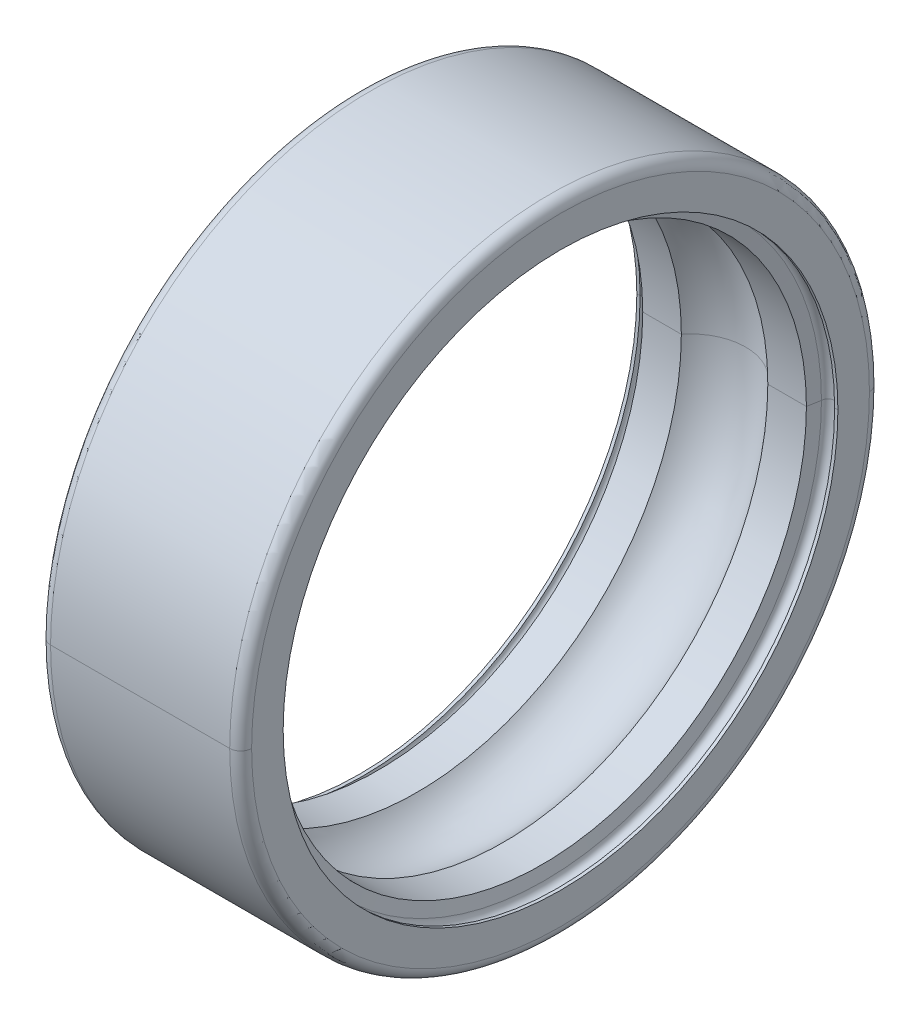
ISO-10303-21;
HEADER;
FILE_DESCRIPTION(('STEP AP214'),'2;1');
FILE_NAME('part.step','',(''),(''),'','','');
FILE_SCHEMA(('AUTOMOTIVE_DESIGN { 1 0 10303 214 1 1 1 1 }'));
ENDSEC;
DATA;
#1=APPLICATION_CONTEXT('core data for automotive mechanical design processes');
#2=APPLICATION_PROTOCOL_DEFINITION('international standard','automotive_design',2000,#1);
#3=PRODUCT_CONTEXT('',#1,'mechanical');
#4=PRODUCT('Part','Part','',(#3));
#5=PRODUCT_RELATED_PRODUCT_CATEGORY('part','',(#4));
#6=PRODUCT_DEFINITION_FORMATION('','',#4);
#7=PRODUCT_DEFINITION_CONTEXT('part definition',#1,'design');
#8=PRODUCT_DEFINITION('design','',#6,#7);
#9=PRODUCT_DEFINITION_SHAPE('','',#8);
#10=(LENGTH_UNIT() NAMED_UNIT(*) SI_UNIT(.MILLI.,.METRE.));
#11=(NAMED_UNIT(*) PLANE_ANGLE_UNIT() SI_UNIT($,.RADIAN.));
#12=(NAMED_UNIT(*) SI_UNIT($,.STERADIAN.) SOLID_ANGLE_UNIT());
#13=UNCERTAINTY_MEASURE_WITH_UNIT(LENGTH_MEASURE(1.E-05),#10,'distance_accuracy_value','');
#14=(GEOMETRIC_REPRESENTATION_CONTEXT(3) GLOBAL_UNCERTAINTY_ASSIGNED_CONTEXT((#13)) GLOBAL_UNIT_ASSIGNED_CONTEXT((#10,
#11,#12)) REPRESENTATION_CONTEXT('',''));
#15=CARTESIAN_POINT('',(0.,0.,0.));
#16=DIRECTION('',(0.,0.,1.));
#17=DIRECTION('',(1.,0.,0.));
#18=AXIS2_PLACEMENT_3D('',#15,#16,#17);
#19=CARTESIAN_POINT('',(0.,16.9,0.));
#20=DIRECTION('',(-1.,0.,0.));
#21=DIRECTION('',(0.,0.,1.));
#22=AXIS2_PLACEMENT_3D('',#19,#20,#21);
#23=PLANE('',#22);
#24=CARTESIAN_POINT('',(0.,0.,0.));
#25=DIRECTION('',(1.,0.,0.));
#26=DIRECTION('',(0.,0.,-1.));
#27=AXIS2_PLACEMENT_3D('',#24,#25,#26);
#28=CIRCLE('',#27,15.175);
#29=CARTESIAN_POINT('',(0.,0.,-15.175));
#30=VERTEX_POINT('',#29);
#31=CARTESIAN_POINT('',(0.,0.,15.175));
#32=VERTEX_POINT('',#31);
#33=EDGE_CURVE('E11',#30,#32,#28,.T.);
#34=ORIENTED_EDGE('',*,*,#33,.T.);
#35=CARTESIAN_POINT('',(0.,0.,0.));
#36=DIRECTION('',(1.,0.,0.));
#37=DIRECTION('',(0.,0.,-1.));
#38=AXIS2_PLACEMENT_3D('',#35,#36,#37);
#39=CIRCLE('',#38,15.175);
#40=EDGE_CURVE('E26',#32,#30,#39,.T.);
#41=ORIENTED_EDGE('',*,*,#40,.T.);
#42=EDGE_LOOP('',(#34,#41));
#43=FACE_BOUND('',#42,.T.);
#44=CARTESIAN_POINT('',(0.,0.,0.));
#45=DIRECTION('',(1.,0.,0.));
#46=DIRECTION('',(0.,0.,-1.));
#47=AXIS2_PLACEMENT_3D('',#44,#45,#46);
#48=CIRCLE('',#47,16.9);
#49=CARTESIAN_POINT('',(0.,0.,-16.9));
#50=VERTEX_POINT('',#49);
#51=CARTESIAN_POINT('',(-1.21014309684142E-13,0.,16.9));
#52=VERTEX_POINT('',#51);
#53=EDGE_CURVE('E623',#50,#52,#48,.T.);
#54=ORIENTED_EDGE('',*,*,#53,.F.);
#55=CARTESIAN_POINT('',(0.,0.,0.));
#56=DIRECTION('',(1.,0.,0.));
#57=DIRECTION('',(0.,0.,-1.));
#58=AXIS2_PLACEMENT_3D('',#55,#56,#57);
#59=CIRCLE('',#58,16.9);
#60=EDGE_CURVE('E620',#52,#50,#59,.T.);
#61=ORIENTED_EDGE('',*,*,#60,.F.);
#62=EDGE_LOOP('',(#54,#61));
#63=FACE_BOUND('',#62,.T.);
#64=ADVANCED_FACE('F17',(#43,#63),#23,.T.);
#65=CARTESIAN_POINT('',(0.599999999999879,0.,0.));
#66=DIRECTION('',(1.,0.,0.));
#67=DIRECTION('',(0.,1.,0.));
#68=AXIS2_PLACEMENT_3D('',#65,#66,#67);
#69=TOROIDAL_SURFACE('',#68,16.9,0.6);
#70=ORIENTED_EDGE('',*,*,#60,.T.);
#71=CARTESIAN_POINT('',(-1.20996962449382E-13,0.,-16.9));
#72=CARTESIAN_POINT('',(-2.08253385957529E-07,0.,-16.9098174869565));
#73=CARTESIAN_POINT('',(0.000240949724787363,0.,-16.9196349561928));
#74=CARTESIAN_POINT('',(0.00120450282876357,0.,-16.9392462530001));
#75=CARTESIAN_POINT('',(0.00192689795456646,0.,-16.9490400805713));
#76=CARTESIAN_POINT('',(0.00385143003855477,0.,-16.9685804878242));
#77=CARTESIAN_POINT('',(0.00505356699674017,0.,-16.9783270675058));
#78=CARTESIAN_POINT('',(0.00793462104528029,0.,-16.9977495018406));
#79=CARTESIAN_POINT('',(0.00961353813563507,0.,-17.0074253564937));
#80=CARTESIAN_POINT('',(0.0134441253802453,0.,-17.0266830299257));
#81=CARTESIAN_POINT('',(0.0155957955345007,0.,-17.0362648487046));
#82=CARTESIAN_POINT('',(0.0203667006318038,0.,-17.0553113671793));
#83=CARTESIAN_POINT('',(0.0229859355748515,0.,-17.0647760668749));
#84=CARTESIAN_POINT('',(0.0286856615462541,0.,-17.0835655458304));
#85=CARTESIAN_POINT('',(0.0317661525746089,0.,-17.0928903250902));
#86=CARTESIAN_POINT('',(0.0383809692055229,0.,-17.1113774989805));
#87=CARTESIAN_POINT('',(0.0419152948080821,0.,-17.120539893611));
#88=CARTESIAN_POINT('',(0.0494292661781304,0.,-17.1386802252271));
#89=CARTESIAN_POINT('',(0.0534089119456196,0.,-17.1476581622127));
#90=CARTESIAN_POINT('',(0.0618039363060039,0.,-17.1654079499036));
#91=CARTESIAN_POINT('',(0.0662193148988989,0.,-17.1741798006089));
#92=CARTESIAN_POINT('',(0.0754751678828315,0.,-17.1914962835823));
#93=CARTESIAN_POINT('',(0.0803156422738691,0.,-17.2000409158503));
#94=CARTESIAN_POINT('',(0.0904100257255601,0.,-17.2168823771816));
#95=CARTESIAN_POINT('',(0.0956639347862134,0.,-17.2251792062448));
#96=CARTESIAN_POINT('',(0.106572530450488,0.,-17.2415050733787));
#97=CARTESIAN_POINT('',(0.112227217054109,0.,-17.2495341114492));
#98=CARTESIAN_POINT('',(0.123923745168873,0.,-17.2653050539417));
#99=CARTESIAN_POINT('',(0.129965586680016,0.,-17.2730469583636));
#100=CARTESIAN_POINT('',(0.142421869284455,0.,-17.2882249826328));
#101=CARTESIAN_POINT('',(0.148836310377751,0.,-17.2956611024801));
#102=CARTESIAN_POINT('',(0.162022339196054,0.,-17.3102096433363));
#103=CARTESIAN_POINT('',(0.16879392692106,0.,-17.317322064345));
#104=CARTESIAN_POINT('',(0.182677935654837,0.,-17.3312060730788));
#105=CARTESIAN_POINT('',(0.189790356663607,0.,-17.3379776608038));
#106=CARTESIAN_POINT('',(0.204338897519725,0.,-17.3511636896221));
#107=CARTESIAN_POINT('',(0.211775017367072,0.,-17.3575781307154));
#108=CARTESIAN_POINT('',(0.226953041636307,0.,-17.3700344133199));
#109=CARTESIAN_POINT('',(0.234694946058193,0.,-17.376076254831));
#110=CARTESIAN_POINT('',(0.250465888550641,0.,-17.3877727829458));
#111=CARTESIAN_POINT('',(0.258494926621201,0.,-17.3934274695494));
#112=CARTESIAN_POINT('',(0.27482079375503,0.,-17.4043360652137));
#113=CARTESIAN_POINT('',(0.283117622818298,0.,-17.4095899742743));
#114=CARTESIAN_POINT('',(0.299959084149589,0.,-17.419684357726));
#115=CARTESIAN_POINT('',(0.308503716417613,0.,-17.424524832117));
#116=CARTESIAN_POINT('',(0.325820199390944,0.,-17.433780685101));
#117=CARTESIAN_POINT('',(0.334592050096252,0.,-17.4381960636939));
#118=CARTESIAN_POINT('',(0.352341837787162,0.,-17.4465910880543));
#119=CARTESIAN_POINT('',(0.361319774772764,0.,-17.4505707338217));
#120=CARTESIAN_POINT('',(0.379460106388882,0.,-17.4580847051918));
#121=CARTESIAN_POINT('',(0.388622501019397,0.,-17.4616190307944));
#122=CARTESIAN_POINT('',(0.407109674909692,0.,-17.4682338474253));
#123=CARTESIAN_POINT('',(0.416434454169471,0.,-17.4713143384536));
#124=CARTESIAN_POINT('',(0.435223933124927,0.,-17.477014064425));
#125=CARTESIAN_POINT('',(0.444688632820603,0.,-17.4796332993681));
#126=CARTESIAN_POINT('',(0.463735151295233,0.,-17.4844042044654));
#127=CARTESIAN_POINT('',(0.473316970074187,0.,-17.4865558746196));
#128=CARTESIAN_POINT('',(0.492574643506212,0.,-17.4903864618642));
#129=CARTESIAN_POINT('',(0.502250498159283,0.,-17.4920653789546));
#130=CARTESIAN_POINT('',(0.521672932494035,0.,-17.4949464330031));
#131=CARTESIAN_POINT('',(0.531419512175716,0.,-17.4961485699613));
#132=CARTESIAN_POINT('',(0.550959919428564,0.,-17.4980731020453));
#133=CARTESIAN_POINT('',(0.560753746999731,0.,-17.4987954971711));
#134=CARTESIAN_POINT('',(0.58036504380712,0.,-17.4997590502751));
#135=CARTESIAN_POINT('',(0.590182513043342,0.,-17.5000002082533));
#136=CARTESIAN_POINT('',(0.599999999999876,0.,-17.5));
#137=B_SPLINE_CURVE_WITH_KNOTS('',3,(#71,#72,#73,#74,#75,#76,#77,#78,#79,#80,#81,#82,#83,#84,
#85,#86,#87,#88,#89,#90,#91,#92,#93,#94,#95,#96,#97,#98,#99,#100,#101,#102,#103,#104,#105,#106,
#107,#108,#109,#110,#111,#112,#113,#114,#115,#116,#117,#118,#119,#120,#121,#122,#123,#124,#125,
#126,#127,#128,#129,#130,#131,#132,#133,#134,#135,#136),.UNSPECIFIED.,.F.,.F.,(4,2,2,2,2,2,2,2,
2,2,2,2,2,2,2,2,2,2,2,2,2,2,2,2,2,2,2,2,2,2,2,2,4),(0.,0.0294494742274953,0.0588989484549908,
0.0883484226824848,0.117797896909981,0.147247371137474,0.176696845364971,0.206146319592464,
0.235595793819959,0.265045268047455,0.294494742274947,0.323944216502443,0.353393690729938,
0.382843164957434,0.412292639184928,0.441742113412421,0.471191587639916,0.500641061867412,
0.530090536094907,0.559540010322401,0.588989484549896,0.618438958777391,0.647888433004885,
0.67733790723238,0.706787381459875,0.736236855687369,0.765686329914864,0.795135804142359,
0.824585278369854,0.854034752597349,0.883484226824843,0.912933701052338,0.942383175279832),.UNSPECIFIED.);
#138=CARTESIAN_POINT('',(0.600000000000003,0.,-17.5));
#139=VERTEX_POINT('',#138);
#140=EDGE_CURVE('E586',#50,#139,#137,.T.);
#141=ORIENTED_EDGE('',*,*,#140,.T.);
#142=CARTESIAN_POINT('',(0.600000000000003,0.,0.));
#143=DIRECTION('',(1.,0.,0.));
#144=DIRECTION('',(0.,0.,-1.));
#145=AXIS2_PLACEMENT_3D('',#142,#143,#144);
#146=CIRCLE('',#145,17.5);
#147=CARTESIAN_POINT('',(0.600000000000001,0.,17.5));
#148=VERTEX_POINT('',#147);
#149=EDGE_CURVE('E605',#148,#139,#146,.T.);
#150=ORIENTED_EDGE('',*,*,#149,.F.);
#151=CARTESIAN_POINT('',(-1.20996962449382E-13,0.,16.9));
#152=CARTESIAN_POINT('',(-2.08253385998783E-07,0.,16.9098174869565));
#153=CARTESIAN_POINT('',(0.000240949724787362,0.,16.9196349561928));
#154=CARTESIAN_POINT('',(0.00120450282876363,0.,16.9392462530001));
#155=CARTESIAN_POINT('',(0.0019268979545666,0.,16.9490400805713));
#156=CARTESIAN_POINT('',(0.00385143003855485,0.,16.9685804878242));
#157=CARTESIAN_POINT('',(0.00505356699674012,0.,16.9783270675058));
#158=CARTESIAN_POINT('',(0.00793462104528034,0.,16.9977495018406));
#159=CARTESIAN_POINT('',(0.00961353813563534,0.,17.0074253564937));
#160=CARTESIAN_POINT('',(0.0134441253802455,0.,17.0266830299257));
#161=CARTESIAN_POINT('',(0.0155957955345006,0.,17.0362648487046));
#162=CARTESIAN_POINT('',(0.0203667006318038,0.,17.0553113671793));
#163=CARTESIAN_POINT('',(0.0229859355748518,0.,17.0647760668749));
#164=CARTESIAN_POINT('',(0.0286856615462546,0.,17.0835655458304));
#165=CARTESIAN_POINT('',(0.0317661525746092,0.,17.0928903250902));
#166=CARTESIAN_POINT('',(0.038380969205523,0.,17.1113774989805));
#167=CARTESIAN_POINT('',(0.0419152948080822,0.,17.120539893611));
#168=CARTESIAN_POINT('',(0.0494292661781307,0.,17.1386802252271));
#169=CARTESIAN_POINT('',(0.0534089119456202,0.,17.1476581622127));
#170=CARTESIAN_POINT('',(0.0618039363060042,0.,17.1654079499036));
#171=CARTESIAN_POINT('',(0.0662193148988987,0.,17.1741798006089));
#172=CARTESIAN_POINT('',(0.0754751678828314,0.,17.1914962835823));
#173=CARTESIAN_POINT('',(0.0803156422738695,0.,17.2000409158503));
#174=CARTESIAN_POINT('',(0.0904100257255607,0.,17.2168823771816));
#175=CARTESIAN_POINT('',(0.0956639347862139,0.,17.2251792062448));
#176=CARTESIAN_POINT('',(0.106572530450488,0.,17.2415050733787));
#177=CARTESIAN_POINT('',(0.112227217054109,0.,17.2495341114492));
#178=CARTESIAN_POINT('',(0.123923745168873,0.,17.2653050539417));
#179=CARTESIAN_POINT('',(0.129965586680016,0.,17.2730469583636));
#180=CARTESIAN_POINT('',(0.142421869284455,0.,17.2882249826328));
#181=CARTESIAN_POINT('',(0.14883631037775,0.,17.2956611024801));
#182=CARTESIAN_POINT('',(0.162022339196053,0.,17.3102096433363));
#183=CARTESIAN_POINT('',(0.168793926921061,0.,17.317322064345));
#184=CARTESIAN_POINT('',(0.182677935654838,0.,17.3312060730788));
#185=CARTESIAN_POINT('',(0.189790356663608,0.,17.3379776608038));
#186=CARTESIAN_POINT('',(0.204338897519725,0.,17.3511636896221));
#187=CARTESIAN_POINT('',(0.211775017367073,0.,17.3575781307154));
#188=CARTESIAN_POINT('',(0.226953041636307,0.,17.3700344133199));
#189=CARTESIAN_POINT('',(0.234694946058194,0.,17.376076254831));
#190=CARTESIAN_POINT('',(0.250465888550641,0.,17.3877727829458));
#191=CARTESIAN_POINT('',(0.258494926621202,0.,17.3934274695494));
#192=CARTESIAN_POINT('',(0.27482079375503,0.,17.4043360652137));
#193=CARTESIAN_POINT('',(0.283117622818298,0.,17.4095899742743));
#194=CARTESIAN_POINT('',(0.29995908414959,0.,17.419684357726));
#195=CARTESIAN_POINT('',(0.308503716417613,0.,17.424524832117));
#196=CARTESIAN_POINT('',(0.325820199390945,0.,17.433780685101));
#197=CARTESIAN_POINT('',(0.334592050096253,0.,17.4381960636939));
#198=CARTESIAN_POINT('',(0.352341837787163,0.,17.4465910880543));
#199=CARTESIAN_POINT('',(0.361319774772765,0.,17.4505707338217));
#200=CARTESIAN_POINT('',(0.379460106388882,0.,17.4580847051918));
#201=CARTESIAN_POINT('',(0.388622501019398,0.,17.4616190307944));
#202=CARTESIAN_POINT('',(0.407109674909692,0.,17.4682338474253));
#203=CARTESIAN_POINT('',(0.416434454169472,0.,17.4713143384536));
#204=CARTESIAN_POINT('',(0.435223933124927,0.,17.477014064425));
#205=CARTESIAN_POINT('',(0.444688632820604,0.,17.4796332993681));
#206=CARTESIAN_POINT('',(0.463735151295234,0.,17.4844042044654));
#207=CARTESIAN_POINT('',(0.473316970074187,0.,17.4865558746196));
#208=CARTESIAN_POINT('',(0.492574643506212,0.,17.4903864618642));
#209=CARTESIAN_POINT('',(0.502250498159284,0.,17.4920653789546));
#210=CARTESIAN_POINT('',(0.521672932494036,0.,17.4949464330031));
#211=CARTESIAN_POINT('',(0.531419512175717,0.,17.4961485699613));
#212=CARTESIAN_POINT('',(0.550959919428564,0.,17.4980731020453));
#213=CARTESIAN_POINT('',(0.560753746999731,0.,17.4987954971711));
#214=CARTESIAN_POINT('',(0.580365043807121,0.,17.4997590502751));
#215=CARTESIAN_POINT('',(0.590182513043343,0.,17.5000002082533));
#216=CARTESIAN_POINT('',(0.599999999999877,0.,17.5));
#217=B_SPLINE_CURVE_WITH_KNOTS('',3,(#151,#152,#153,#154,#155,#156,#157,#158,#159,#160,#161,
#162,#163,#164,#165,#166,#167,#168,#169,#170,#171,#172,#173,#174,#175,#176,#177,#178,#179,#180,
#181,#182,#183,#184,#185,#186,#187,#188,#189,#190,#191,#192,#193,#194,#195,#196,#197,#198,#199,
#200,#201,#202,#203,#204,#205,#206,#207,#208,#209,#210,#211,#212,#213,#214,#215,#216),
.UNSPECIFIED.,.F.,.F.,(4,2,2,2,2,2,2,2,2,2,2,2,2,2,2,2,2,2,2,2,2,2,2,2,2,2,2,2,2,2,2,2,4),(0.,
0.0294494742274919,0.0588989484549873,0.0883484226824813,0.117797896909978,0.147247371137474,
0.176696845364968,0.206146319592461,0.235595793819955,0.265045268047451,0.294494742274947,
0.32394421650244,0.353393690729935,0.38284316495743,0.412292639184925,0.441742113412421,
0.471191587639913,0.500641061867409,0.530090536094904,0.559540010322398,0.588989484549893,
0.618438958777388,0.647888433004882,0.677337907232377,0.706787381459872,0.736236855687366,
0.765686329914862,0.795135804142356,0.824585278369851,0.854034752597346,0.88348422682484,
0.912933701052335,0.94238317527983),.UNSPECIFIED.);
#218=EDGE_CURVE('E590',#52,#148,#217,.T.);
#219=ORIENTED_EDGE('',*,*,#218,.F.);
#220=EDGE_LOOP('',(#70,#141,#150,#219));
#221=FACE_BOUND('',#220,.T.);
#222=ADVANCED_FACE('F570',(#221),#69,.T.);
#223=CARTESIAN_POINT('',(0.599999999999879,0.,0.));
#224=DIRECTION('',(1.,0.,0.));
#225=DIRECTION('',(0.,-1.,0.));
#226=AXIS2_PLACEMENT_3D('',#223,#224,#225);
#227=TOROIDAL_SURFACE('',#226,16.9,0.6);
#228=CARTESIAN_POINT('',(0.600000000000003,0.,0.));
#229=DIRECTION('',(1.,0.,0.));
#230=DIRECTION('',(0.,0.,-1.));
#231=AXIS2_PLACEMENT_3D('',#228,#229,#230);
#232=CIRCLE('',#231,17.5);
#233=EDGE_CURVE('E551',#139,#148,#232,.T.);
#234=ORIENTED_EDGE('',*,*,#233,.F.);
#235=ORIENTED_EDGE('',*,*,#140,.F.);
#236=ORIENTED_EDGE('',*,*,#53,.T.);
#237=ORIENTED_EDGE('',*,*,#218,.T.);
#238=EDGE_LOOP('',(#234,#235,#236,#237));
#239=FACE_BOUND('',#238,.T.);
#240=ADVANCED_FACE('F560',(#239),#227,.T.);
#241=CARTESIAN_POINT('',(50.,0.,0.));
#242=DIRECTION('',(-1.,0.,0.));
#243=DIRECTION('',(0.,-1.,0.));
#244=AXIS2_PLACEMENT_3D('',#241,#242,#243);
#245=CYLINDRICAL_SURFACE('',#244,17.5);
#246=CARTESIAN_POINT('',(10.4,0.,0.));
#247=DIRECTION('',(1.,0.,0.));
#248=DIRECTION('',(0.,0.,-1.));
#249=AXIS2_PLACEMENT_3D('',#246,#247,#248);
#250=CIRCLE('',#249,17.5);
#251=CARTESIAN_POINT('',(10.4,0.,-17.5));
#252=VERTEX_POINT('',#251);
#253=CARTESIAN_POINT('',(10.4000000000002,0.,17.5));
#254=VERTEX_POINT('',#253);
#255=EDGE_CURVE('E546',#252,#254,#250,.T.);
#256=ORIENTED_EDGE('',*,*,#255,.F.);
#257=DIRECTION('',(-1.,0.,0.));
#258=VECTOR('',#257,1.);
#259=CARTESIAN_POINT('',(10.4,0.,-17.5));
#260=LINE('',#259,#258);
#261=EDGE_CURVE('E540',#252,#139,#260,.T.);
#262=ORIENTED_EDGE('',*,*,#261,.T.);
#263=ORIENTED_EDGE('',*,*,#233,.T.);
#264=DIRECTION('',(-1.,0.,0.));
#265=VECTOR('',#264,1.);
#266=CARTESIAN_POINT('',(10.4,0.,17.5));
#267=LINE('',#266,#265);
#268=EDGE_CURVE('E534',#254,#148,#267,.T.);
#269=ORIENTED_EDGE('',*,*,#268,.F.);
#270=EDGE_LOOP('',(#256,#262,#263,#269));
#271=FACE_BOUND('',#270,.T.);
#272=ADVANCED_FACE('F569',(#271),#245,.T.);
#273=CARTESIAN_POINT('',(50.,0.,0.));
#274=DIRECTION('',(-1.,0.,0.));
#275=DIRECTION('',(0.,1.,0.));
#276=AXIS2_PLACEMENT_3D('',#273,#274,#275);
#277=CYLINDRICAL_SURFACE('',#276,17.5);
#278=ORIENTED_EDGE('',*,*,#149,.T.);
#279=ORIENTED_EDGE('',*,*,#261,.F.);
#280=CARTESIAN_POINT('',(10.4,0.,0.));
#281=DIRECTION('',(1.,0.,0.));
#282=DIRECTION('',(0.,0.,-1.));
#283=AXIS2_PLACEMENT_3D('',#280,#281,#282);
#284=CIRCLE('',#283,17.5);
#285=EDGE_CURVE('E531',#254,#252,#284,.T.);
#286=ORIENTED_EDGE('',*,*,#285,.F.);
#287=ORIENTED_EDGE('',*,*,#268,.T.);
#288=EDGE_LOOP('',(#278,#279,#286,#287));
#289=FACE_BOUND('',#288,.T.);
#290=ADVANCED_FACE('F674',(#289),#277,.T.);
#291=CARTESIAN_POINT('',(10.4000000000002,0.,0.));
#292=DIRECTION('',(1.,0.,0.));
#293=DIRECTION('',(0.,1.,0.));
#294=AXIS2_PLACEMENT_3D('',#291,#292,#293);
#295=TOROIDAL_SURFACE('',#294,16.9,0.6);
#296=ORIENTED_EDGE('',*,*,#285,.T.);
#297=CARTESIAN_POINT('',(10.4000000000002,0.,-17.5));
#298=CARTESIAN_POINT('',(10.4098174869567,0.,-17.5000002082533));
#299=CARTESIAN_POINT('',(10.419634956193,0.,-17.4997590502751));
#300=CARTESIAN_POINT('',(10.4392462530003,0.,-17.4987954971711));
#301=CARTESIAN_POINT('',(10.4490400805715,0.,-17.4980731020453));
#302=CARTESIAN_POINT('',(10.4685804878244,0.,-17.4961485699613));
#303=CARTESIAN_POINT('',(10.478327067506,0.,-17.4949464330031));
#304=CARTESIAN_POINT('',(10.4977495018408,0.,-17.4920653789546));
#305=CARTESIAN_POINT('',(10.5074253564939,0.,-17.4903864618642));
#306=CARTESIAN_POINT('',(10.5266830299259,0.,-17.4865558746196));
#307=CARTESIAN_POINT('',(10.5362648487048,0.,-17.4844042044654));
#308=CARTESIAN_POINT('',(10.5553113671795,0.,-17.4796332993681));
#309=CARTESIAN_POINT('',(10.5647760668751,0.,-17.477014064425));
#310=CARTESIAN_POINT('',(10.5835655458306,0.,-17.4713143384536));
#311=CARTESIAN_POINT('',(10.5928903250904,0.,-17.4682338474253));
#312=CARTESIAN_POINT('',(10.6113774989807,0.,-17.4616190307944));
#313=CARTESIAN_POINT('',(10.6205398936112,0.,-17.4580847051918));
#314=CARTESIAN_POINT('',(10.6386802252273,0.,-17.4505707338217));
#315=CARTESIAN_POINT('',(10.6476581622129,0.,-17.4465910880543));
#316=CARTESIAN_POINT('',(10.6654079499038,0.,-17.4381960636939));
#317=CARTESIAN_POINT('',(10.6741798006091,0.,-17.433780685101));
#318=CARTESIAN_POINT('',(10.6914962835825,0.,-17.424524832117));
#319=CARTESIAN_POINT('',(10.7000409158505,0.,-17.419684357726));
#320=CARTESIAN_POINT('',(10.7168823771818,0.,-17.4095899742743));
#321=CARTESIAN_POINT('',(10.725179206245,0.,-17.4043360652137));
#322=CARTESIAN_POINT('',(10.7415050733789,0.,-17.3934274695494));
#323=CARTESIAN_POINT('',(10.7495341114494,0.,-17.3877727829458));
#324=CARTESIAN_POINT('',(10.7653050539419,0.,-17.376076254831));
#325=CARTESIAN_POINT('',(10.7730469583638,0.,-17.3700344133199));
#326=CARTESIAN_POINT('',(10.788224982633,0.,-17.3575781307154));
#327=CARTESIAN_POINT('',(10.7956611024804,0.,-17.3511636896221));
#328=CARTESIAN_POINT('',(10.8102096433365,0.,-17.3379776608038));
#329=CARTESIAN_POINT('',(10.8173220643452,0.,-17.3312060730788));
#330=CARTESIAN_POINT('',(10.831206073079,0.,-17.317322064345));
#331=CARTESIAN_POINT('',(10.837977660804,0.,-17.3102096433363));
#332=CARTESIAN_POINT('',(10.8511636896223,0.,-17.2956611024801));
#333=CARTESIAN_POINT('',(10.8575781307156,0.,-17.2882249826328));
#334=CARTESIAN_POINT('',(10.8700344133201,0.,-17.2730469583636));
#335=CARTESIAN_POINT('',(10.8760762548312,0.,-17.2653050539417));
#336=CARTESIAN_POINT('',(10.887772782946,0.,-17.2495341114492));
#337=CARTESIAN_POINT('',(10.8934274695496,0.,-17.2415050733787));
#338=CARTESIAN_POINT('',(10.9043360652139,0.,-17.2251792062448));
#339=CARTESIAN_POINT('',(10.9095899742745,0.,-17.2168823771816));
#340=CARTESIAN_POINT('',(10.9196843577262,0.,-17.2000409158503));
#341=CARTESIAN_POINT('',(10.9245248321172,0.,-17.1914962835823));
#342=CARTESIAN_POINT('',(10.9337806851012,0.,-17.1741798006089));
#343=CARTESIAN_POINT('',(10.9381960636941,0.,-17.1654079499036));
#344=CARTESIAN_POINT('',(10.9465910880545,0.,-17.1476581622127));
#345=CARTESIAN_POINT('',(10.9505707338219,0.,-17.1386802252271));
#346=CARTESIAN_POINT('',(10.958084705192,0.,-17.120539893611));
#347=CARTESIAN_POINT('',(10.9616190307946,0.,-17.1113774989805));
#348=CARTESIAN_POINT('',(10.9682338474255,0.,-17.0928903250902));
#349=CARTESIAN_POINT('',(10.9713143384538,0.,-17.0835655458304));
#350=CARTESIAN_POINT('',(10.9770140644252,0.,-17.064776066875));
#351=CARTESIAN_POINT('',(10.9796332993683,0.,-17.0553113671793));
#352=CARTESIAN_POINT('',(10.9844042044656,0.,-17.0362648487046));
#353=CARTESIAN_POINT('',(10.9865558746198,0.,-17.0266830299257));
#354=CARTESIAN_POINT('',(10.9903864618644,0.,-17.0074253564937));
#355=CARTESIAN_POINT('',(10.9920653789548,0.,-16.9977495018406));
#356=CARTESIAN_POINT('',(10.9949464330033,0.,-16.9783270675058));
#357=CARTESIAN_POINT('',(10.9961485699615,0.,-16.9685804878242));
#358=CARTESIAN_POINT('',(10.9980731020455,0.,-16.9490400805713));
#359=CARTESIAN_POINT('',(10.9987954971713,0.,-16.9392462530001));
#360=CARTESIAN_POINT('',(10.9997590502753,0.,-16.9196349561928));
#361=CARTESIAN_POINT('',(11.0000002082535,0.,-16.9098174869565));
#362=CARTESIAN_POINT('',(11.0000000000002,0.,-16.9));
#363=B_SPLINE_CURVE_WITH_KNOTS('',3,(#297,#298,#299,#300,#301,#302,#303,#304,#305,#306,#307,
#308,#309,#310,#311,#312,#313,#314,#315,#316,#317,#318,#319,#320,#321,#322,#323,#324,#325,#326,
#327,#328,#329,#330,#331,#332,#333,#334,#335,#336,#337,#338,#339,#340,#341,#342,#343,#344,#345,
#346,#347,#348,#349,#350,#351,#352,#353,#354,#355,#356,#357,#358,#359,#360,#361,#362),
.UNSPECIFIED.,.F.,.F.,(4,2,2,2,2,2,2,2,2,2,2,2,2,2,2,2,2,2,2,2,2,2,2,2,2,2,2,2,2,2,2,2,4),(0.,
0.0294494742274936,0.0588989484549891,0.0883484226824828,0.117797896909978,0.147247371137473,
0.176696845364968,0.206146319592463,0.235595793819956,0.265045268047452,0.294494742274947,
0.323944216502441,0.353393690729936,0.38284316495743,0.412292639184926,0.441742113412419,
0.471191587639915,0.500641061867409,0.530090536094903,0.559540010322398,0.588989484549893,
0.618438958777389,0.647888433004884,0.677337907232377,0.706787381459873,0.736236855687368,
0.765686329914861,0.795135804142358,0.824585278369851,0.854034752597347,0.883484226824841,
0.912933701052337,0.942383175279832),.UNSPECIFIED.);
#364=CARTESIAN_POINT('',(11.,0.,-16.9));
#365=VERTEX_POINT('',#364);
#366=EDGE_CURVE('E497',#252,#365,#363,.T.);
#367=ORIENTED_EDGE('',*,*,#366,.T.);
#368=CARTESIAN_POINT('',(11.,0.,0.));
#369=DIRECTION('',(1.,0.,0.));
#370=DIRECTION('',(0.,0.,-1.));
#371=AXIS2_PLACEMENT_3D('',#368,#369,#370);
#372=CIRCLE('',#371,16.9);
#373=CARTESIAN_POINT('',(11.0000000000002,0.,16.9));
#374=VERTEX_POINT('',#373);
#375=EDGE_CURVE('E516',#374,#365,#372,.T.);
#376=ORIENTED_EDGE('',*,*,#375,.F.);
#377=CARTESIAN_POINT('',(10.4000000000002,0.,17.5));
#378=CARTESIAN_POINT('',(10.4098174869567,0.,17.5000002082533));
#379=CARTESIAN_POINT('',(10.419634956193,0.,17.4997590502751));
#380=CARTESIAN_POINT('',(10.4392462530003,0.,17.4987954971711));
#381=CARTESIAN_POINT('',(10.4490400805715,0.,17.4980731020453));
#382=CARTESIAN_POINT('',(10.4685804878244,0.,17.4961485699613));
#383=CARTESIAN_POINT('',(10.478327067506,0.,17.4949464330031));
#384=CARTESIAN_POINT('',(10.4977495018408,0.,17.4920653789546));
#385=CARTESIAN_POINT('',(10.5074253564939,0.,17.4903864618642));
#386=CARTESIAN_POINT('',(10.5266830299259,0.,17.4865558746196));
#387=CARTESIAN_POINT('',(10.5362648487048,0.,17.4844042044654));
#388=CARTESIAN_POINT('',(10.5553113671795,0.,17.4796332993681));
#389=CARTESIAN_POINT('',(10.5647760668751,0.,17.477014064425));
#390=CARTESIAN_POINT('',(10.5835655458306,0.,17.4713143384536));
#391=CARTESIAN_POINT('',(10.5928903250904,0.,17.4682338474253));
#392=CARTESIAN_POINT('',(10.6113774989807,0.,17.4616190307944));
#393=CARTESIAN_POINT('',(10.6205398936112,0.,17.4580847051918));
#394=CARTESIAN_POINT('',(10.6386802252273,0.,17.4505707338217));
#395=CARTESIAN_POINT('',(10.6476581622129,0.,17.4465910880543));
#396=CARTESIAN_POINT('',(10.6654079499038,0.,17.4381960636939));
#397=CARTESIAN_POINT('',(10.6741798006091,0.,17.433780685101));
#398=CARTESIAN_POINT('',(10.6914962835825,0.,17.424524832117));
#399=CARTESIAN_POINT('',(10.7000409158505,0.,17.419684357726));
#400=CARTESIAN_POINT('',(10.7168823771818,0.,17.4095899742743));
#401=CARTESIAN_POINT('',(10.725179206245,0.,17.4043360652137));
#402=CARTESIAN_POINT('',(10.7415050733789,0.,17.3934274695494));
#403=CARTESIAN_POINT('',(10.7495341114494,0.,17.3877727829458));
#404=CARTESIAN_POINT('',(10.7653050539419,0.,17.376076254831));
#405=CARTESIAN_POINT('',(10.7730469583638,0.,17.3700344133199));
#406=CARTESIAN_POINT('',(10.788224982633,0.,17.3575781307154));
#407=CARTESIAN_POINT('',(10.7956611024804,0.,17.3511636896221));
#408=CARTESIAN_POINT('',(10.8102096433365,0.,17.3379776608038));
#409=CARTESIAN_POINT('',(10.8173220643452,0.,17.3312060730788));
#410=CARTESIAN_POINT('',(10.831206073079,0.,17.317322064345));
#411=CARTESIAN_POINT('',(10.837977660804,0.,17.3102096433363));
#412=CARTESIAN_POINT('',(10.8511636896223,0.,17.2956611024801));
#413=CARTESIAN_POINT('',(10.8575781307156,0.,17.2882249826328));
#414=CARTESIAN_POINT('',(10.8700344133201,0.,17.2730469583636));
#415=CARTESIAN_POINT('',(10.8760762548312,0.,17.2653050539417));
#416=CARTESIAN_POINT('',(10.887772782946,0.,17.2495341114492));
#417=CARTESIAN_POINT('',(10.8934274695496,0.,17.2415050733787));
#418=CARTESIAN_POINT('',(10.9043360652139,0.,17.2251792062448));
#419=CARTESIAN_POINT('',(10.9095899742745,0.,17.2168823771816));
#420=CARTESIAN_POINT('',(10.9196843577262,0.,17.2000409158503));
#421=CARTESIAN_POINT('',(10.9245248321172,0.,17.1914962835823));
#422=CARTESIAN_POINT('',(10.9337806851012,0.,17.1741798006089));
#423=CARTESIAN_POINT('',(10.9381960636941,0.,17.1654079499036));
#424=CARTESIAN_POINT('',(10.9465910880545,0.,17.1476581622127));
#425=CARTESIAN_POINT('',(10.9505707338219,0.,17.1386802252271));
#426=CARTESIAN_POINT('',(10.958084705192,0.,17.120539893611));
#427=CARTESIAN_POINT('',(10.9616190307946,0.,17.1113774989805));
#428=CARTESIAN_POINT('',(10.9682338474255,0.,17.0928903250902));
#429=CARTESIAN_POINT('',(10.9713143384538,0.,17.0835655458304));
#430=CARTESIAN_POINT('',(10.9770140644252,0.,17.0647760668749));
#431=CARTESIAN_POINT('',(10.9796332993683,0.,17.0553113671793));
#432=CARTESIAN_POINT('',(10.9844042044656,0.,17.0362648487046));
#433=CARTESIAN_POINT('',(10.9865558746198,0.,17.0266830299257));
#434=CARTESIAN_POINT('',(10.9903864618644,0.,17.0074253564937));
#435=CARTESIAN_POINT('',(10.9920653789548,0.,16.9977495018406));
#436=CARTESIAN_POINT('',(10.9949464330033,0.,16.9783270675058));
#437=CARTESIAN_POINT('',(10.9961485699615,0.,16.9685804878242));
#438=CARTESIAN_POINT('',(10.9980731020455,0.,16.9490400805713));
#439=CARTESIAN_POINT('',(10.9987954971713,0.,16.9392462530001));
#440=CARTESIAN_POINT('',(10.9997590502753,0.,16.9196349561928));
#441=CARTESIAN_POINT('',(11.0000002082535,0.,16.9098174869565));
#442=CARTESIAN_POINT('',(11.0000000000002,0.,16.9));
#443=B_SPLINE_CURVE_WITH_KNOTS('',3,(#377,#378,#379,#380,#381,#382,#383,#384,#385,#386,#387,
#388,#389,#390,#391,#392,#393,#394,#395,#396,#397,#398,#399,#400,#401,#402,#403,#404,#405,#406,
#407,#408,#409,#410,#411,#412,#413,#414,#415,#416,#417,#418,#419,#420,#421,#422,#423,#424,#425,
#426,#427,#428,#429,#430,#431,#432,#433,#434,#435,#436,#437,#438,#439,#440,#441,#442),
.UNSPECIFIED.,.F.,.F.,(4,2,2,2,2,2,2,2,2,2,2,2,2,2,2,2,2,2,2,2,2,2,2,2,2,2,2,2,2,2,2,2,4),(0.,
0.0294494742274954,0.0588989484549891,0.0883484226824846,0.11779789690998,0.147247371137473,
0.176696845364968,0.206146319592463,0.235595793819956,0.265045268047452,0.294494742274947,
0.323944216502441,0.353393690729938,0.38284316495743,0.412292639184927,0.441742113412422,
0.471191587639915,0.500641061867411,0.530090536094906,0.559540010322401,0.588989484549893,
0.618438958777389,0.647888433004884,0.67733790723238,0.706787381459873,0.736236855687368,
0.765686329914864,0.795135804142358,0.824585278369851,0.854034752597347,0.883484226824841,
0.912933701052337,0.942383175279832),.UNSPECIFIED.);
#444=EDGE_CURVE('E501',#254,#374,#443,.T.);
#445=ORIENTED_EDGE('',*,*,#444,.F.);
#446=EDGE_LOOP('',(#296,#367,#376,#445));
#447=FACE_BOUND('',#446,.T.);
#448=ADVANCED_FACE('F479',(#447),#295,.T.);
#449=CARTESIAN_POINT('',(10.4000000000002,0.,0.));
#450=DIRECTION('',(1.,0.,0.));
#451=DIRECTION('',(0.,-1.,0.));
#452=AXIS2_PLACEMENT_3D('',#449,#450,#451);
#453=TOROIDAL_SURFACE('',#452,16.9,0.6);
#454=CARTESIAN_POINT('',(11.,0.,0.));
#455=DIRECTION('',(1.,0.,0.));
#456=DIRECTION('',(0.,0.,-1.));
#457=AXIS2_PLACEMENT_3D('',#454,#455,#456);
#458=CIRCLE('',#457,16.9);
#459=EDGE_CURVE('E459',#365,#374,#458,.T.);
#460=ORIENTED_EDGE('',*,*,#459,.F.);
#461=ORIENTED_EDGE('',*,*,#366,.F.);
#462=ORIENTED_EDGE('',*,*,#255,.T.);
#463=ORIENTED_EDGE('',*,*,#444,.T.);
#464=EDGE_LOOP('',(#460,#461,#462,#463));
#465=FACE_BOUND('',#464,.T.);
#466=ADVANCED_FACE('F468',(#465),#453,.T.);
#467=CARTESIAN_POINT('',(11.,15.175,0.));
#468=DIRECTION('',(1.,0.,0.));
#469=DIRECTION('',(0.,0.,-1.));
#470=AXIS2_PLACEMENT_3D('',#467,#468,#469);
#471=PLANE('',#470);
#472=ORIENTED_EDGE('',*,*,#459,.T.);
#473=ORIENTED_EDGE('',*,*,#375,.T.);
#474=EDGE_LOOP('',(#472,#473));
#475=FACE_BOUND('',#474,.T.);
#476=CARTESIAN_POINT('',(11.,0.,0.));
#477=DIRECTION('',(1.,0.,0.));
#478=DIRECTION('',(0.,0.,-1.));
#479=AXIS2_PLACEMENT_3D('',#476,#477,#478);
#480=CIRCLE('',#479,15.175);
#481=CARTESIAN_POINT('',(11.,0.,-15.175));
#482=VERTEX_POINT('',#481);
#483=CARTESIAN_POINT('',(11.,0.,15.175));
#484=VERTEX_POINT('',#483);
#485=EDGE_CURVE('E453',#482,#484,#480,.T.);
#486=ORIENTED_EDGE('',*,*,#485,.F.);
#487=CARTESIAN_POINT('',(11.,0.,0.));
#488=DIRECTION('',(1.,0.,0.));
#489=DIRECTION('',(0.,0.,-1.));
#490=AXIS2_PLACEMENT_3D('',#487,#488,#489);
#491=CIRCLE('',#490,15.175);
#492=EDGE_CURVE('E447',#484,#482,#491,.T.);
#493=ORIENTED_EDGE('',*,*,#492,.F.);
#494=EDGE_LOOP('',(#486,#493));
#495=FACE_BOUND('',#494,.T.);
#496=ADVANCED_FACE('F478',(#475,#495),#471,.T.);
#497=CARTESIAN_POINT('',(50.,0.,0.));
#498=DIRECTION('',(-1.,0.,0.));
#499=DIRECTION('',(0.,1.,0.));
#500=AXIS2_PLACEMENT_3D('',#497,#498,#499);
#501=CYLINDRICAL_SURFACE('',#500,15.175);
#502=CARTESIAN_POINT('',(10.82,0.,0.));
#503=DIRECTION('',(1.,0.,0.));
#504=DIRECTION('',(0.,0.,-1.));
#505=AXIS2_PLACEMENT_3D('',#502,#503,#504);
#506=CIRCLE('',#505,15.175);
#507=CARTESIAN_POINT('',(10.82,0.,15.175));
#508=VERTEX_POINT('',#507);
#509=CARTESIAN_POINT('',(10.82,0.,-15.175));
#510=VERTEX_POINT('',#509);
#511=EDGE_CURVE('E442',#508,#510,#506,.T.);
#512=ORIENTED_EDGE('',*,*,#511,.F.);
#513=DIRECTION('',(-1.,0.,0.));
#514=VECTOR('',#513,1.);
#515=CARTESIAN_POINT('',(11.,0.,15.175));
#516=LINE('',#515,#514);
#517=EDGE_CURVE('E436',#484,#508,#516,.T.);
#518=ORIENTED_EDGE('',*,*,#517,.F.);
#519=ORIENTED_EDGE('',*,*,#492,.T.);
#520=DIRECTION('',(-1.,0.,0.));
#521=VECTOR('',#520,1.);
#522=CARTESIAN_POINT('',(11.,0.,-15.175));
#523=LINE('',#522,#521);
#524=EDGE_CURVE('E431',#482,#510,#523,.T.);
#525=ORIENTED_EDGE('',*,*,#524,.T.);
#526=EDGE_LOOP('',(#512,#518,#519,#525));
#527=FACE_BOUND('',#526,.T.);
#528=ADVANCED_FACE('F754',(#527),#501,.F.);
#529=CARTESIAN_POINT('',(50.,0.,0.));
#530=DIRECTION('',(-1.,0.,0.));
#531=DIRECTION('',(0.,-1.,0.));
#532=AXIS2_PLACEMENT_3D('',#529,#530,#531);
#533=CYLINDRICAL_SURFACE('',#532,15.175);
#534=ORIENTED_EDGE('',*,*,#485,.T.);
#535=ORIENTED_EDGE('',*,*,#517,.T.);
#536=CARTESIAN_POINT('',(10.82,0.,0.));
#537=DIRECTION('',(1.,0.,0.));
#538=DIRECTION('',(0.,0.,-1.));
#539=AXIS2_PLACEMENT_3D('',#536,#537,#538);
#540=CIRCLE('',#539,15.175);
#541=EDGE_CURVE('E428',#510,#508,#540,.T.);
#542=ORIENTED_EDGE('',*,*,#541,.F.);
#543=ORIENTED_EDGE('',*,*,#524,.F.);
#544=EDGE_LOOP('',(#534,#535,#542,#543));
#545=FACE_BOUND('',#544,.T.);
#546=ADVANCED_FACE('F765',(#545),#533,.F.);
#547=CARTESIAN_POINT('',(10.46,0.,0.));
#548=DIRECTION('',(1.,0.,0.));
#549=DIRECTION('',(0.,-1.,0.));
#550=AXIS2_PLACEMENT_3D('',#547,#548,#549);
#551=TOROIDAL_SURFACE('',#550,15.175000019,0.36);
#552=ORIENTED_EDGE('',*,*,#541,.T.);
#553=CARTESIAN_POINT('',(10.1,0.,15.175));
#554=CARTESIAN_POINT('',(10.0999998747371,0.,15.1808904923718));
#555=CARTESIAN_POINT('',(10.1001445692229,0.,15.1867809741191));
#556=CARTESIAN_POINT('',(10.1007227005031,0.,15.1985477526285));
#557=CARTESIAN_POINT('',(10.1011561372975,0.,15.2044240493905));
#558=CARTESIAN_POINT('',(10.1023108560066,0.,15.2161482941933));
#559=CARTESIAN_POINT('',(10.1030321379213,0.,15.221996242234));
#560=CARTESIAN_POINT('',(10.1047607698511,0.,15.2336497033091));
#561=CARTESIAN_POINT('',(10.1057681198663,0.,15.2394552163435));
#562=CARTESIAN_POINT('',(10.1080664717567,0.,15.251009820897));
#563=CARTESIAN_POINT('',(10.1093574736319,0.,15.2567589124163));
#564=CARTESIAN_POINT('',(10.1122200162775,0.,15.2681868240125));
#565=CARTESIAN_POINT('',(10.113791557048,0.,15.2738656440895));
#566=CARTESIAN_POINT('',(10.1172113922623,0.,15.2851393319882));
#567=CARTESIAN_POINT('',(10.1190596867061,0.,15.2907341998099));
#568=CARTESIAN_POINT('',(10.1230285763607,0.,15.3018265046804));
#569=CARTESIAN_POINT('',(10.1251491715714,0.,15.3073239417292));
#570=CARTESIAN_POINT('',(10.129657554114,0.,15.3182081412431));
#571=CARTESIAN_POINT('',(10.132045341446,0.,15.3235949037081));
#572=CARTESIAN_POINT('',(10.1370823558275,0.,15.3342447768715));
#573=CARTESIAN_POINT('',(10.139731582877,0.,15.33950788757));
#574=CARTESIAN_POINT('',(10.145285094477,0.,15.3498977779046));
#575=CARTESIAN_POINT('',(10.1481893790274,0.,15.3550245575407));
#576=CARTESIAN_POINT('',(10.1542460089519,0.,15.3651294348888));
#577=CARTESIAN_POINT('',(10.157398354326,0.,15.3701075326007));
#578=CARTESIAN_POINT('',(10.1639435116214,0.,15.379903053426));
#579=CARTESIAN_POINT('',(10.1673363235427,0.,15.3847204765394));
#580=CARTESIAN_POINT('',(10.1743542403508,0.,15.3941830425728));
#581=CARTESIAN_POINT('',(10.1779793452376,0.,15.3988281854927));
#582=CARTESIAN_POINT('',(10.185453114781,0.,15.4079350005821));
#583=CARTESIAN_POINT('',(10.1893017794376,0.,15.4123966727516));
#584=CARTESIAN_POINT('',(10.1972133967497,0.,15.4211257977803));
#585=CARTESIAN_POINT('',(10.2012763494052,0.,15.4253932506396));
#586=CARTESIAN_POINT('',(10.2096067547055,0.,15.4337236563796));
#587=CARTESIAN_POINT('',(10.2138742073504,0.,15.4377866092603));
#588=CARTESIAN_POINT('',(10.2226033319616,0.,15.4456982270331));
#589=CARTESIAN_POINT('',(10.227065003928,0.,15.4495468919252));
#590=CARTESIAN_POINT('',(10.2361718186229,0.,15.4570206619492));
#591=CARTESIAN_POINT('',(10.2408169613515,0.,15.4606457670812));
#592=CARTESIAN_POINT('',(10.2502795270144,0.,15.4676636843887));
#593=CARTESIAN_POINT('',(10.2550969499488,0.,15.4710564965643));
#594=CARTESIAN_POINT('',(10.2648924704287,0.,15.4776016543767));
#595=CARTESIAN_POINT('',(10.2698705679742,0.,15.4807540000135));
#596=CARTESIAN_POINT('',(10.2799754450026,0.,15.4868106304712));
#597=CARTESIAN_POINT('',(10.2851022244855,0.,15.4897149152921));
#598=CARTESIAN_POINT('',(10.295492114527,0.,15.4952684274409));
#599=CARTESIAN_POINT('',(10.3007552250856,0.,15.4979176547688));
#600=CARTESIAN_POINT('',(10.3114050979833,0.,15.5029546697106));
#601=CARTESIAN_POINT('',(10.3167918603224,0.,15.5053424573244));
#602=CARTESIAN_POINT('',(10.3276760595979,0.,15.5098508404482));
#603=CARTESIAN_POINT('',(10.3331734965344,0.,15.5119714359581));
#604=CARTESIAN_POINT('',(10.3442658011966,0.,15.5159403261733));
#605=CARTESIAN_POINT('',(10.3498606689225,0.,15.5177886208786));
#606=CARTESIAN_POINT('',(10.3611343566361,0.,15.5212084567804));
#607=CARTESIAN_POINT('',(10.366813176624,0.,15.5227799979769));
#608=CARTESIAN_POINT('',(10.3782410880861,0.,15.5256425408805));
#609=CARTESIAN_POINT('',(10.3839901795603,0.,15.5269335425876));
#610=CARTESIAN_POINT('',(10.3955447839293,0.,15.529231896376));
#611=CARTESIAN_POINT('',(10.4013502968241,0.,15.5302392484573));
#612=CARTESIAN_POINT('',(10.4130037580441,0.,15.5319678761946));
#613=CARTESIAN_POINT('',(10.4188517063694,0.,15.5326891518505));
#614=CARTESIAN_POINT('',(10.4305759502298,0.,15.5338438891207));
#615=CARTESIAN_POINT('',(10.4364522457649,0.,15.5342773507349));
#616=CARTESIAN_POINT('',(10.4482190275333,0.,15.5348554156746));
#617=CARTESIAN_POINT('',(10.4541095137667,0.,15.535000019));
#618=CARTESIAN_POINT('',(10.4658904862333,0.,15.535000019));
#619=CARTESIAN_POINT('',(10.4717809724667,0.,15.5348554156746));
#620=CARTESIAN_POINT('',(10.4835477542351,0.,15.5342773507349));
#621=CARTESIAN_POINT('',(10.4894240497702,0.,15.5338438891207));
#622=CARTESIAN_POINT('',(10.5011482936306,0.,15.5326891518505));
#623=CARTESIAN_POINT('',(10.5069962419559,0.,15.5319678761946));
#624=CARTESIAN_POINT('',(10.5186497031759,0.,15.5302392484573));
#625=CARTESIAN_POINT('',(10.5244552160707,0.,15.529231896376));
#626=CARTESIAN_POINT('',(10.5360098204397,0.,15.5269335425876));
#627=CARTESIAN_POINT('',(10.5417589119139,0.,15.5256425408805));
#628=CARTESIAN_POINT('',(10.553186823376,0.,15.5227799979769));
#629=CARTESIAN_POINT('',(10.5588656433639,0.,15.5212084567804));
#630=CARTESIAN_POINT('',(10.5701393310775,0.,15.5177886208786));
#631=CARTESIAN_POINT('',(10.5757341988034,0.,15.5159403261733));
#632=CARTESIAN_POINT('',(10.5868265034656,0.,15.5119714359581));
#633=CARTESIAN_POINT('',(10.5923239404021,0.,15.5098508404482));
#634=CARTESIAN_POINT('',(10.6032081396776,0.,15.5053424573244));
#635=CARTESIAN_POINT('',(10.6085949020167,0.,15.5029546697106));
#636=CARTESIAN_POINT('',(10.6192447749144,0.,15.4979176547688));
#637=CARTESIAN_POINT('',(10.624507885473,0.,15.4952684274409));
#638=CARTESIAN_POINT('',(10.6348977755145,0.,15.4897149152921));
#639=CARTESIAN_POINT('',(10.6400245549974,0.,15.4868106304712));
#640=CARTESIAN_POINT('',(10.6501294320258,0.,15.4807540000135));
#641=CARTESIAN_POINT('',(10.6551075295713,0.,15.4776016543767));
#642=CARTESIAN_POINT('',(10.6649030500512,0.,15.4710564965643));
#643=CARTESIAN_POINT('',(10.6697204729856,0.,15.4676636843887));
#644=CARTESIAN_POINT('',(10.6791830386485,0.,15.4606457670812));
#645=CARTESIAN_POINT('',(10.6838281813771,0.,15.4570206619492));
#646=CARTESIAN_POINT('',(10.692934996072,0.,15.4495468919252));
#647=CARTESIAN_POINT('',(10.6973966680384,0.,15.4456982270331));
#648=CARTESIAN_POINT('',(10.7061257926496,0.,15.4377866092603));
#649=CARTESIAN_POINT('',(10.7103932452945,0.,15.4337236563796));
#650=CARTESIAN_POINT('',(10.7187236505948,0.,15.4253932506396));
#651=CARTESIAN_POINT('',(10.7227866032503,0.,15.4211257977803));
#652=CARTESIAN_POINT('',(10.7306982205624,0.,15.4123966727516));
#653=CARTESIAN_POINT('',(10.734546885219,0.,15.4079350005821));
#654=CARTESIAN_POINT('',(10.7420206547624,0.,15.3988281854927));
#655=CARTESIAN_POINT('',(10.7456457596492,0.,15.3941830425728));
#656=CARTESIAN_POINT('',(10.7526636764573,0.,15.3847204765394));
#657=CARTESIAN_POINT('',(10.7560564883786,0.,15.379903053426));
#658=CARTESIAN_POINT('',(10.762601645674,0.,15.3701075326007));
#659=CARTESIAN_POINT('',(10.7657539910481,0.,15.3651294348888));
#660=CARTESIAN_POINT('',(10.7718106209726,0.,15.3550245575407));
#661=CARTESIAN_POINT('',(10.774714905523,0.,15.3498977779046));
#662=CARTESIAN_POINT('',(10.780268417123,0.,15.33950788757));
#663=CARTESIAN_POINT('',(10.7829176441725,0.,15.3342447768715));
#664=CARTESIAN_POINT('',(10.787954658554,0.,15.3235949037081));
#665=CARTESIAN_POINT('',(10.790342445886,0.,15.3182081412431));
#666=CARTESIAN_POINT('',(10.7948508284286,0.,15.3073239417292));
#667=CARTESIAN_POINT('',(10.7969714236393,0.,15.3018265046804));
#668=CARTESIAN_POINT('',(10.8009403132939,0.,15.2907341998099));
#669=CARTESIAN_POINT('',(10.8027886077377,0.,15.2851393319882));
#670=CARTESIAN_POINT('',(10.806208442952,0.,15.2738656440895));
#671=CARTESIAN_POINT('',(10.8077799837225,0.,15.2681868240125));
#672=CARTESIAN_POINT('',(10.8106425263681,0.,15.2567589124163));
#673=CARTESIAN_POINT('',(10.8119335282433,0.,15.251009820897));
#674=CARTESIAN_POINT('',(10.8142318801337,0.,15.2394552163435));
#675=CARTESIAN_POINT('',(10.8152392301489,0.,15.2336497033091));
#676=CARTESIAN_POINT('',(10.8169678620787,0.,15.221996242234));
#677=CARTESIAN_POINT('',(10.8176891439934,0.,15.2161482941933));
#678=CARTESIAN_POINT('',(10.8188438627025,0.,15.2044240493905));
#679=CARTESIAN_POINT('',(10.8192772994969,0.,15.1985477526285));
#680=CARTESIAN_POINT('',(10.8198554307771,0.,15.1867809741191));
#681=CARTESIAN_POINT('',(10.8200001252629,0.,15.1808904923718));
#682=CARTESIAN_POINT('',(10.82,0.,15.175));
#683=B_SPLINE_CURVE_WITH_KNOTS('',3,(#553,#554,#555,#556,#557,#558,#559,#560,#561,#562,#563,
#564,#565,#566,#567,#568,#569,#570,#571,#572,#573,#574,#575,#576,#577,#578,#579,#580,#581,#582,
#583,#584,#585,#586,#587,#588,#589,#590,#591,#592,#593,#594,#595,#596,#597,#598,#599,#600,#601,
#602,#603,#604,#605,#606,#607,#608,#609,#610,#611,#612,#613,#614,#615,#616,#617,#618,#619,#620,
#621,#622,#623,#624,#625,#626,#627,#628,#629,#630,#631,#632,#633,#634,#635,#636,#637,#638,#639,
#640,#641,#642,#643,#644,#645,#646,#647,#648,#649,#650,#651,#652,#653,#654,#655,#656,#657,#658,
#659,#660,#661,#662,#663,#664,#665,#666,#667,#668,#669,#670,#671,#672,#673,#674,#675,#676,#677,
#678,#679,#680,#681,#682),.UNSPECIFIED.,.F.,.F.,(4,2,2,2,2,2,2,2,2,2,2,2,2,2,2,2,2,2,2,2,2,2,2,
2,2,2,2,2,2,2,2,2,2,2,2,2,2,2,2,2,2,2,2,2,2,2,2,2,2,2,2,2,2,2,2,2,2,2,2,2,2,2,2,2,4),(0.,
0.0176696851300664,0.0353393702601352,0.0530090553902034,0.0706787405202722,0.0883484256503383,
0.106018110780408,0.123687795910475,0.141357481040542,0.159027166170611,0.176696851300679,
0.194366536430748,0.212036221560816,0.229705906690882,0.247375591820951,0.265045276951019,
0.282714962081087,0.300384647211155,0.318054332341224,0.335724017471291,0.353393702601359,
0.371063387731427,0.388733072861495,0.406402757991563,0.42407244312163,0.441742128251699,
0.459411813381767,0.477081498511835,0.494751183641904,0.512420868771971,0.530090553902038,
0.547760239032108,0.565429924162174,0.583099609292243,0.60076929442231,0.61843897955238,
0.636108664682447,0.653778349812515,0.671448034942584,0.689117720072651,0.706787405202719,
0.724457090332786,0.742126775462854,0.759796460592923,0.777466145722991,0.795135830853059,
0.812805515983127,0.830475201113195,0.848144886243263,0.865814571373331,0.883484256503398,
0.901153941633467,0.918823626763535,0.936493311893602,0.954162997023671,0.971832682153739,
0.989502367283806,1.00717205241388,1.02484173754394,1.04251142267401,1.06018110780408,
1.07785079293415,1.09552047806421,1.11319016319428,1.13085984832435),.UNSPECIFIED.);
#684=CARTESIAN_POINT('',(10.0999999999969,0.,15.1750000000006));
#685=VERTEX_POINT('',#684);
#686=EDGE_CURVE('E394',#685,#508,#683,.T.);
#687=ORIENTED_EDGE('',*,*,#686,.F.);
#688=CARTESIAN_POINT('',(10.1,0.,0.));
#689=DIRECTION('',(1.,0.,0.));
#690=DIRECTION('',(0.,0.,-1.));
#691=AXIS2_PLACEMENT_3D('',#688,#689,#690);
#692=CIRCLE('',#691,15.175);
#693=CARTESIAN_POINT('',(10.1,0.,-15.175));
#694=VERTEX_POINT('',#693);
#695=EDGE_CURVE('E413',#694,#685,#692,.T.);
#696=ORIENTED_EDGE('',*,*,#695,.F.);
#697=CARTESIAN_POINT('',(10.1,0.,-15.175));
#698=CARTESIAN_POINT('',(10.0999998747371,0.,-15.1808904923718));
#699=CARTESIAN_POINT('',(10.1001445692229,0.,-15.1867809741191));
#700=CARTESIAN_POINT('',(10.1007227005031,0.,-15.1985477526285));
#701=CARTESIAN_POINT('',(10.1011561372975,0.,-15.2044240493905));
#702=CARTESIAN_POINT('',(10.1023108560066,0.,-15.2161482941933));
#703=CARTESIAN_POINT('',(10.1030321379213,0.,-15.221996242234));
#704=CARTESIAN_POINT('',(10.1047607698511,0.,-15.2336497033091));
#705=CARTESIAN_POINT('',(10.1057681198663,0.,-15.2394552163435));
#706=CARTESIAN_POINT('',(10.1080664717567,0.,-15.251009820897));
#707=CARTESIAN_POINT('',(10.1093574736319,0.,-15.2567589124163));
#708=CARTESIAN_POINT('',(10.1122200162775,0.,-15.2681868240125));
#709=CARTESIAN_POINT('',(10.113791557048,0.,-15.2738656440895));
#710=CARTESIAN_POINT('',(10.1172113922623,0.,-15.2851393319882));
#711=CARTESIAN_POINT('',(10.1190596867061,0.,-15.2907341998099));
#712=CARTESIAN_POINT('',(10.1230285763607,0.,-15.3018265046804));
#713=CARTESIAN_POINT('',(10.1251491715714,0.,-15.3073239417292));
#714=CARTESIAN_POINT('',(10.129657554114,0.,-15.3182081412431));
#715=CARTESIAN_POINT('',(10.132045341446,0.,-15.3235949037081));
#716=CARTESIAN_POINT('',(10.1370823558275,0.,-15.3342447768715));
#717=CARTESIAN_POINT('',(10.139731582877,0.,-15.33950788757));
#718=CARTESIAN_POINT('',(10.145285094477,0.,-15.3498977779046));
#719=CARTESIAN_POINT('',(10.1481893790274,0.,-15.3550245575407));
#720=CARTESIAN_POINT('',(10.1542460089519,0.,-15.3651294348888));
#721=CARTESIAN_POINT('',(10.157398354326,0.,-15.3701075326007));
#722=CARTESIAN_POINT('',(10.1639435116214,0.,-15.379903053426));
#723=CARTESIAN_POINT('',(10.1673363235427,0.,-15.3847204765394));
#724=CARTESIAN_POINT('',(10.1743542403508,0.,-15.3941830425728));
#725=CARTESIAN_POINT('',(10.1779793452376,0.,-15.3988281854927));
#726=CARTESIAN_POINT('',(10.185453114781,0.,-15.4079350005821));
#727=CARTESIAN_POINT('',(10.1893017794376,0.,-15.4123966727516));
#728=CARTESIAN_POINT('',(10.1972133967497,0.,-15.4211257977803));
#729=CARTESIAN_POINT('',(10.2012763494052,0.,-15.4253932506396));
#730=CARTESIAN_POINT('',(10.2096067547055,0.,-15.4337236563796));
#731=CARTESIAN_POINT('',(10.2138742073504,0.,-15.4377866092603));
#732=CARTESIAN_POINT('',(10.2226033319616,0.,-15.4456982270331));
#733=CARTESIAN_POINT('',(10.227065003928,0.,-15.4495468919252));
#734=CARTESIAN_POINT('',(10.2361718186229,0.,-15.4570206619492));
#735=CARTESIAN_POINT('',(10.2408169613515,0.,-15.4606457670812));
#736=CARTESIAN_POINT('',(10.2502795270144,0.,-15.4676636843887));
#737=CARTESIAN_POINT('',(10.2550969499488,0.,-15.4710564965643));
#738=CARTESIAN_POINT('',(10.2648924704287,0.,-15.4776016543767));
#739=CARTESIAN_POINT('',(10.2698705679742,0.,-15.4807540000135));
#740=CARTESIAN_POINT('',(10.2799754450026,0.,-15.4868106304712));
#741=CARTESIAN_POINT('',(10.2851022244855,0.,-15.4897149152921));
#742=CARTESIAN_POINT('',(10.295492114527,0.,-15.4952684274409));
#743=CARTESIAN_POINT('',(10.3007552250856,0.,-15.4979176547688));
#744=CARTESIAN_POINT('',(10.3114050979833,0.,-15.5029546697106));
#745=CARTESIAN_POINT('',(10.3167918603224,0.,-15.5053424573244));
#746=CARTESIAN_POINT('',(10.3276760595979,0.,-15.5098508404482));
#747=CARTESIAN_POINT('',(10.3331734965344,0.,-15.5119714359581));
#748=CARTESIAN_POINT('',(10.3442658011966,0.,-15.5159403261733));
#749=CARTESIAN_POINT('',(10.3498606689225,0.,-15.5177886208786));
#750=CARTESIAN_POINT('',(10.3611343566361,0.,-15.5212084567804));
#751=CARTESIAN_POINT('',(10.366813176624,0.,-15.5227799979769));
#752=CARTESIAN_POINT('',(10.3782410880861,0.,-15.5256425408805));
#753=CARTESIAN_POINT('',(10.3839901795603,0.,-15.5269335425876));
#754=CARTESIAN_POINT('',(10.3955447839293,0.,-15.529231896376));
#755=CARTESIAN_POINT('',(10.4013502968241,0.,-15.5302392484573));
#756=CARTESIAN_POINT('',(10.4130037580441,0.,-15.5319678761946));
#757=CARTESIAN_POINT('',(10.4188517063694,0.,-15.5326891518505));
#758=CARTESIAN_POINT('',(10.4305759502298,0.,-15.5338438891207));
#759=CARTESIAN_POINT('',(10.4364522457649,0.,-15.5342773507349));
#760=CARTESIAN_POINT('',(10.4482190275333,0.,-15.5348554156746));
#761=CARTESIAN_POINT('',(10.4541095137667,0.,-15.535000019));
#762=CARTESIAN_POINT('',(10.4658904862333,0.,-15.535000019));
#763=CARTESIAN_POINT('',(10.4717809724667,0.,-15.5348554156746));
#764=CARTESIAN_POINT('',(10.4835477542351,0.,-15.5342773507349));
#765=CARTESIAN_POINT('',(10.4894240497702,0.,-15.5338438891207));
#766=CARTESIAN_POINT('',(10.5011482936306,0.,-15.5326891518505));
#767=CARTESIAN_POINT('',(10.5069962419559,0.,-15.5319678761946));
#768=CARTESIAN_POINT('',(10.5186497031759,0.,-15.5302392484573));
#769=CARTESIAN_POINT('',(10.5244552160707,0.,-15.529231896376));
#770=CARTESIAN_POINT('',(10.5360098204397,0.,-15.5269335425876));
#771=CARTESIAN_POINT('',(10.5417589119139,0.,-15.5256425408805));
#772=CARTESIAN_POINT('',(10.553186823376,0.,-15.5227799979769));
#773=CARTESIAN_POINT('',(10.5588656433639,0.,-15.5212084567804));
#774=CARTESIAN_POINT('',(10.5701393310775,0.,-15.5177886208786));
#775=CARTESIAN_POINT('',(10.5757341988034,0.,-15.5159403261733));
#776=CARTESIAN_POINT('',(10.5868265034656,0.,-15.5119714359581));
#777=CARTESIAN_POINT('',(10.5923239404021,0.,-15.5098508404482));
#778=CARTESIAN_POINT('',(10.6032081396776,0.,-15.5053424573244));
#779=CARTESIAN_POINT('',(10.6085949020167,0.,-15.5029546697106));
#780=CARTESIAN_POINT('',(10.6192447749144,0.,-15.4979176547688));
#781=CARTESIAN_POINT('',(10.624507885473,0.,-15.4952684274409));
#782=CARTESIAN_POINT('',(10.6348977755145,0.,-15.4897149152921));
#783=CARTESIAN_POINT('',(10.6400245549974,0.,-15.4868106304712));
#784=CARTESIAN_POINT('',(10.6501294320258,0.,-15.4807540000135));
#785=CARTESIAN_POINT('',(10.6551075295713,0.,-15.4776016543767));
#786=CARTESIAN_POINT('',(10.6649030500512,0.,-15.4710564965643));
#787=CARTESIAN_POINT('',(10.6697204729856,0.,-15.4676636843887));
#788=CARTESIAN_POINT('',(10.6791830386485,0.,-15.4606457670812));
#789=CARTESIAN_POINT('',(10.6838281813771,0.,-15.4570206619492));
#790=CARTESIAN_POINT('',(10.692934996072,0.,-15.4495468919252));
#791=CARTESIAN_POINT('',(10.6973966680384,0.,-15.4456982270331));
#792=CARTESIAN_POINT('',(10.7061257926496,0.,-15.4377866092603));
#793=CARTESIAN_POINT('',(10.7103932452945,0.,-15.4337236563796));
#794=CARTESIAN_POINT('',(10.7187236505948,0.,-15.4253932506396));
#795=CARTESIAN_POINT('',(10.7227866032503,0.,-15.4211257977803));
#796=CARTESIAN_POINT('',(10.7306982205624,0.,-15.4123966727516));
#797=CARTESIAN_POINT('',(10.734546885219,0.,-15.4079350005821));
#798=CARTESIAN_POINT('',(10.7420206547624,0.,-15.3988281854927));
#799=CARTESIAN_POINT('',(10.7456457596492,0.,-15.3941830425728));
#800=CARTESIAN_POINT('',(10.7526636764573,0.,-15.3847204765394));
#801=CARTESIAN_POINT('',(10.7560564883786,0.,-15.379903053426));
#802=CARTESIAN_POINT('',(10.762601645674,0.,-15.3701075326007));
#803=CARTESIAN_POINT('',(10.7657539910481,0.,-15.3651294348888));
#804=CARTESIAN_POINT('',(10.7718106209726,0.,-15.3550245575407));
#805=CARTESIAN_POINT('',(10.774714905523,0.,-15.3498977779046));
#806=CARTESIAN_POINT('',(10.780268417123,0.,-15.33950788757));
#807=CARTESIAN_POINT('',(10.7829176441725,0.,-15.3342447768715));
#808=CARTESIAN_POINT('',(10.787954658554,0.,-15.3235949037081));
#809=CARTESIAN_POINT('',(10.790342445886,0.,-15.3182081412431));
#810=CARTESIAN_POINT('',(10.7948508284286,0.,-15.3073239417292));
#811=CARTESIAN_POINT('',(10.7969714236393,0.,-15.3018265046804));
#812=CARTESIAN_POINT('',(10.8009403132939,0.,-15.2907341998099));
#813=CARTESIAN_POINT('',(10.8027886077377,0.,-15.2851393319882));
#814=CARTESIAN_POINT('',(10.806208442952,0.,-15.2738656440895));
#815=CARTESIAN_POINT('',(10.8077799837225,0.,-15.2681868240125));
#816=CARTESIAN_POINT('',(10.8106425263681,0.,-15.2567589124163));
#817=CARTESIAN_POINT('',(10.8119335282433,0.,-15.251009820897));
#818=CARTESIAN_POINT('',(10.8142318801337,0.,-15.2394552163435));
#819=CARTESIAN_POINT('',(10.8152392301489,0.,-15.2336497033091));
#820=CARTESIAN_POINT('',(10.8169678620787,0.,-15.221996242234));
#821=CARTESIAN_POINT('',(10.8176891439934,0.,-15.2161482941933));
#822=CARTESIAN_POINT('',(10.8188438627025,0.,-15.2044240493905));
#823=CARTESIAN_POINT('',(10.8192772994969,0.,-15.1985477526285));
#824=CARTESIAN_POINT('',(10.8198554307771,0.,-15.1867809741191));
#825=CARTESIAN_POINT('',(10.8200001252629,0.,-15.1808904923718));
#826=CARTESIAN_POINT('',(10.82,0.,-15.175));
#827=B_SPLINE_CURVE_WITH_KNOTS('',3,(#697,#698,#699,#700,#701,#702,#703,#704,#705,#706,#707,
#708,#709,#710,#711,#712,#713,#714,#715,#716,#717,#718,#719,#720,#721,#722,#723,#724,#725,#726,
#727,#728,#729,#730,#731,#732,#733,#734,#735,#736,#737,#738,#739,#740,#741,#742,#743,#744,#745,
#746,#747,#748,#749,#750,#751,#752,#753,#754,#755,#756,#757,#758,#759,#760,#761,#762,#763,#764,
#765,#766,#767,#768,#769,#770,#771,#772,#773,#774,#775,#776,#777,#778,#779,#780,#781,#782,#783,
#784,#785,#786,#787,#788,#789,#790,#791,#792,#793,#794,#795,#796,#797,#798,#799,#800,#801,#802,
#803,#804,#805,#806,#807,#808,#809,#810,#811,#812,#813,#814,#815,#816,#817,#818,#819,#820,#821,
#822,#823,#824,#825,#826),.UNSPECIFIED.,.F.,.F.,(4,2,2,2,2,2,2,2,2,2,2,2,2,2,2,2,2,2,2,2,2,2,2,
2,2,2,2,2,2,2,2,2,2,2,2,2,2,2,2,2,2,2,2,2,2,2,2,2,2,2,2,2,2,2,2,2,2,2,2,2,2,2,2,2,4),(0.,
0.0176696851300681,0.0353393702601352,0.0530090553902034,0.0706787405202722,0.08834842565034,
0.106018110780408,0.123687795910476,0.141357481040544,0.159027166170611,0.17669685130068,
0.194366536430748,0.212036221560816,0.229705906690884,0.247375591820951,0.26504527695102,
0.282714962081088,0.300384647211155,0.318054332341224,0.335724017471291,0.353393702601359,
0.371063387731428,0.388733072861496,0.406402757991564,0.424072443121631,0.441742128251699,
0.459411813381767,0.477081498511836,0.494751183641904,0.512420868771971,0.53009055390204,
0.547760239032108,0.565429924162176,0.583099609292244,0.600769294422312,0.61843897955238,
0.636108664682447,0.653778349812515,0.671448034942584,0.689117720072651,0.70678740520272,
0.724457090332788,0.742126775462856,0.759796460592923,0.777466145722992,0.795135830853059,
0.812805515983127,0.830475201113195,0.848144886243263,0.865814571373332,0.883484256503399,
0.901153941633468,0.918823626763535,0.936493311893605,0.954162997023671,0.971832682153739,
0.989502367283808,1.00717205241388,1.02484173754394,1.04251142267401,1.06018110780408,
1.07785079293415,1.09552047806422,1.11319016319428,1.13085984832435),.UNSPECIFIED.);
#828=EDGE_CURVE('E398',#694,#510,#827,.T.);
#829=ORIENTED_EDGE('',*,*,#828,.T.);
#830=EDGE_LOOP('',(#552,#687,#696,#829));
#831=FACE_BOUND('',#830,.T.);
#832=ADVANCED_FACE('F376',(#831),#551,.F.);
#833=CARTESIAN_POINT('',(10.46,0.,0.));
#834=DIRECTION('',(1.,0.,0.));
#835=DIRECTION('',(0.,1.,0.));
#836=AXIS2_PLACEMENT_3D('',#833,#834,#835);
#837=TOROIDAL_SURFACE('',#836,15.175000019,0.36);
#838=CARTESIAN_POINT('',(10.1,0.,0.));
#839=DIRECTION('',(1.,0.,0.));
#840=DIRECTION('',(0.,0.,-1.));
#841=AXIS2_PLACEMENT_3D('',#838,#839,#840);
#842=CIRCLE('',#841,15.175);
#843=EDGE_CURVE('E356',#685,#694,#842,.T.);
#844=ORIENTED_EDGE('',*,*,#843,.F.);
#845=ORIENTED_EDGE('',*,*,#686,.T.);
#846=ORIENTED_EDGE('',*,*,#511,.T.);
#847=ORIENTED_EDGE('',*,*,#828,.F.);
#848=EDGE_LOOP('',(#844,#845,#846,#847));
#849=FACE_BOUND('',#848,.T.);
#850=ADVANCED_FACE('F365',(#849),#837,.F.);
#851=CARTESIAN_POINT('',(9.9765711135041,0.,0.));
#852=DIRECTION('',(1.,0.,0.));
#853=DIRECTION('',(0.,1.,0.));
#854=AXIS2_PLACEMENT_3D('',#851,#852,#853);
#855=CONICAL_SURFACE('',#854,14.475,1.3962634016);
#856=CARTESIAN_POINT('',(9.9765711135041,0.,0.));
#857=DIRECTION('',(1.,0.,0.));
#858=DIRECTION('',(0.,0.,-1.));
#859=AXIS2_PLACEMENT_3D('',#856,#857,#858);
#860=CIRCLE('',#859,14.475);
#861=CARTESIAN_POINT('',(9.9765711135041,0.,14.475));
#862=VERTEX_POINT('',#861);
#863=CARTESIAN_POINT('',(9.9765711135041,0.,-14.475));
#864=VERTEX_POINT('',#863);
#865=EDGE_CURVE('E350',#862,#864,#860,.T.);
#866=ORIENTED_EDGE('',*,*,#865,.F.);
#867=DIRECTION('',(0.173648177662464,0.,0.984807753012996));
#868=VECTOR('',#867,1.);
#869=CARTESIAN_POINT('',(9.9765711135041,0.,14.475));
#870=LINE('',#869,#868);
#871=EDGE_CURVE('E344',#862,#685,#870,.T.);
#872=ORIENTED_EDGE('',*,*,#871,.T.);
#873=ORIENTED_EDGE('',*,*,#843,.T.);
#874=DIRECTION('',(0.173648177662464,0.,-0.984807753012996));
#875=VECTOR('',#874,1.);
#876=CARTESIAN_POINT('',(9.9765711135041,0.,-14.475));
#877=LINE('',#876,#875);
#878=EDGE_CURVE('E338',#864,#694,#877,.T.);
#879=ORIENTED_EDGE('',*,*,#878,.F.);
#880=EDGE_LOOP('',(#866,#872,#873,#879));
#881=FACE_BOUND('',#880,.T.);
#882=ADVANCED_FACE('F375',(#881),#855,.F.);
#883=CARTESIAN_POINT('',(9.9765711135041,0.,0.));
#884=DIRECTION('',(1.,0.,0.));
#885=DIRECTION('',(0.,-1.,0.));
#886=AXIS2_PLACEMENT_3D('',#883,#884,#885);
#887=CONICAL_SURFACE('',#886,14.475,1.3962634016);
#888=ORIENTED_EDGE('',*,*,#695,.T.);
#889=ORIENTED_EDGE('',*,*,#871,.F.);
#890=CARTESIAN_POINT('',(9.9765711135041,0.,0.));
#891=DIRECTION('',(1.,0.,0.));
#892=DIRECTION('',(0.,0.,-1.));
#893=AXIS2_PLACEMENT_3D('',#890,#891,#892);
#894=CIRCLE('',#893,14.475);
#895=EDGE_CURVE('E332',#864,#862,#894,.T.);
#896=ORIENTED_EDGE('',*,*,#895,.F.);
#897=ORIENTED_EDGE('',*,*,#878,.T.);
#898=EDGE_LOOP('',(#888,#889,#896,#897));
#899=FACE_BOUND('',#898,.T.);
#900=ADVANCED_FACE('F803',(#899),#887,.F.);
#901=CARTESIAN_POINT('',(50.,0.,0.));
#902=DIRECTION('',(-1.,0.,0.));
#903=DIRECTION('',(0.,-1.,0.));
#904=AXIS2_PLACEMENT_3D('',#901,#902,#903);
#905=CYLINDRICAL_SURFACE('',#904,14.475);
#906=ORIENTED_EDGE('',*,*,#895,.T.);
#907=DIRECTION('',(-1.,0.,0.));
#908=VECTOR('',#907,1.);
#909=CARTESIAN_POINT('',(9.9765711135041,0.,14.475));
#910=LINE('',#909,#908);
#911=CARTESIAN_POINT('',(7.86558132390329,0.,14.475));
#912=VERTEX_POINT('',#911);
#913=EDGE_CURVE('E327',#862,#912,#910,.T.);
#914=ORIENTED_EDGE('',*,*,#913,.T.);
#915=CARTESIAN_POINT('',(7.8655813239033,0.,0.));
#916=DIRECTION('',(1.,0.,0.));
#917=DIRECTION('',(0.,0.,-1.));
#918=AXIS2_PLACEMENT_3D('',#915,#916,#917);
#919=CIRCLE('',#918,14.475);
#920=CARTESIAN_POINT('',(7.8655813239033,0.,-14.475));
#921=VERTEX_POINT('',#920);
#922=EDGE_CURVE('E322',#921,#912,#919,.T.);
#923=ORIENTED_EDGE('',*,*,#922,.F.);
#924=DIRECTION('',(-1.,0.,0.));
#925=VECTOR('',#924,1.);
#926=CARTESIAN_POINT('',(9.9765711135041,0.,-14.475));
#927=LINE('',#926,#925);
#928=EDGE_CURVE('E316',#864,#921,#927,.T.);
#929=ORIENTED_EDGE('',*,*,#928,.F.);
#930=EDGE_LOOP('',(#906,#914,#923,#929));
#931=FACE_BOUND('',#930,.T.);
#932=ADVANCED_FACE('F814',(#931),#905,.F.);
#933=CARTESIAN_POINT('',(50.,0.,0.));
#934=DIRECTION('',(-1.,0.,0.));
#935=DIRECTION('',(0.,1.,0.));
#936=AXIS2_PLACEMENT_3D('',#933,#934,#935);
#937=CYLINDRICAL_SURFACE('',#936,14.475);
#938=CARTESIAN_POINT('',(7.8655813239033,0.,0.));
#939=DIRECTION('',(1.,0.,0.));
#940=DIRECTION('',(0.,0.,-1.));
#941=AXIS2_PLACEMENT_3D('',#938,#939,#940);
#942=CIRCLE('',#941,14.475);
#943=EDGE_CURVE('E311',#912,#921,#942,.T.);
#944=ORIENTED_EDGE('',*,*,#943,.F.);
#945=ORIENTED_EDGE('',*,*,#913,.F.);
#946=ORIENTED_EDGE('',*,*,#865,.T.);
#947=ORIENTED_EDGE('',*,*,#928,.T.);
#948=EDGE_LOOP('',(#944,#945,#946,#947));
#949=FACE_BOUND('',#948,.T.);
#950=ADVANCED_FACE('F825',(#949),#937,.F.);
#951=CARTESIAN_POINT('',(5.5,0.,0.));
#952=DIRECTION('',(1.,0.,0.));
#953=DIRECTION('',(0.,1.,0.));
#954=AXIS2_PLACEMENT_3D('',#951,#952,#953);
#955=TOROIDAL_SURFACE('',#954,12.63,3.);
#956=CARTESIAN_POINT('',(3.1344186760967,0.,0.));
#957=DIRECTION('',(1.,0.,0.));
#958=DIRECTION('',(0.,0.,-1.));
#959=AXIS2_PLACEMENT_3D('',#956,#957,#958);
#960=CIRCLE('',#959,14.475);
#961=CARTESIAN_POINT('',(3.1344186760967,0.,14.475));
#962=VERTEX_POINT('',#961);
#963=CARTESIAN_POINT('',(3.1344186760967,0.,-14.475));
#964=VERTEX_POINT('',#963);
#965=EDGE_CURVE('E307',#962,#964,#960,.T.);
#966=ORIENTED_EDGE('',*,*,#965,.F.);
#967=CARTESIAN_POINT('',(3.13441867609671,0.,14.475));
#968=CARTESIAN_POINT('',(3.16933429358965,0.,14.5197703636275));
#969=CARTESIAN_POINT('',(3.20552358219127,0.,14.5635471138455));
#970=CARTESIAN_POINT('',(3.28032671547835,0.,14.6489777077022));
#971=CARTESIAN_POINT('',(3.3189405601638,0.,14.690631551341));
#972=CARTESIAN_POINT('',(3.39847001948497,0.,14.7716806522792));
#973=CARTESIAN_POINT('',(3.43938563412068,0.,14.8110759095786));
#974=CARTESIAN_POINT('',(3.52338633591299,0.,14.887481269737));
#975=CARTESIAN_POINT('',(3.56647142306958,0.,14.9244913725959));
#976=CARTESIAN_POINT('',(3.65467234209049,0.,14.9960070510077));
#977=CARTESIAN_POINT('',(3.6997881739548,0.,15.0305126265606));
#978=CARTESIAN_POINT('',(3.79190515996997,0.,15.0969080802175));
#979=CARTESIAN_POINT('',(3.83890631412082,0.,15.1287979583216));
#980=CARTESIAN_POINT('',(3.93464248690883,0.,15.189859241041));
#981=CARTESIAN_POINT('',(3.98337750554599,0.,15.2190306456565));
#982=CARTESIAN_POINT('',(4.08242435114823,0.,15.2745609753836));
#983=CARTESIAN_POINT('',(4.13273617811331,0.,15.3009199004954));
#984=CARTESIAN_POINT('',(4.23477450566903,0.,15.3507403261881));
#985=CARTESIAN_POINT('',(4.28650100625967,0.,15.374201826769));
#986=CARTESIAN_POINT('',(4.3912019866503,0.,15.4181517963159));
#987=CARTESIAN_POINT('',(4.44417646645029,0.,15.4386402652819));
#988=CARTESIAN_POINT('',(4.55120268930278,0.,15.4765781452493));
#989=CARTESIAN_POINT('',(4.60525443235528,0.,15.4940275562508));
#990=CARTESIAN_POINT('',(4.71426099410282,0.,15.525831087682));
#991=CARTESIAN_POINT('',(4.76921581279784,0.,15.5401852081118));
#992=CARTESIAN_POINT('',(4.87985142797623,0.,15.5657519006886));
#993=CARTESIAN_POINT('',(4.93553222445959,0.,15.5769644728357));
#994=CARTESIAN_POINT('',(5.04744035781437,0.,15.5962119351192));
#995=CARTESIAN_POINT('',(5.10366769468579,0.,15.6042468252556));
#996=CARTESIAN_POINT('',(5.21648771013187,0.,15.6171130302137));
#997=CARTESIAN_POINT('',(5.27308038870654,0.,15.6219443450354));
#998=CARTESIAN_POINT('',(5.3864487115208,0.,15.6283878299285));
#999=CARTESIAN_POINT('',(5.4432243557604,0.,15.63));
#1000=CARTESIAN_POINT('',(5.55677564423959,0.,15.63));
#1001=CARTESIAN_POINT('',(5.61355128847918,0.,15.6283878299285));
#1002=CARTESIAN_POINT('',(5.72691961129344,0.,15.6219443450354));
#1003=CARTESIAN_POINT('',(5.78351228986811,0.,15.6171130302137));
#1004=CARTESIAN_POINT('',(5.8963323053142,0.,15.6042468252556));
#1005=CARTESIAN_POINT('',(5.95255964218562,0.,15.5962119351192));
#1006=CARTESIAN_POINT('',(6.0644677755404,0.,15.5769644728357));
#1007=CARTESIAN_POINT('',(6.12014857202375,0.,15.5657519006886));
#1008=CARTESIAN_POINT('',(6.23078418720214,0.,15.5401852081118));
#1009=CARTESIAN_POINT('',(6.28573900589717,0.,15.525831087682));
#1010=CARTESIAN_POINT('',(6.3947455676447,0.,15.4940275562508));
#1011=CARTESIAN_POINT('',(6.44879731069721,0.,15.4765781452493));
#1012=CARTESIAN_POINT('',(6.5558235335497,0.,15.4386402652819));
#1013=CARTESIAN_POINT('',(6.60879801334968,0.,15.4181517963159));
#1014=CARTESIAN_POINT('',(6.71349899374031,0.,15.374201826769));
#1015=CARTESIAN_POINT('',(6.76522549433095,0.,15.3507403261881));
#1016=CARTESIAN_POINT('',(6.86726382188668,0.,15.3009199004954));
#1017=CARTESIAN_POINT('',(6.91757564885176,0.,15.2745609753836));
#1018=CARTESIAN_POINT('',(7.016622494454,0.,15.2190306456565));
#1019=CARTESIAN_POINT('',(7.06535751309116,0.,15.189859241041));
#1020=CARTESIAN_POINT('',(7.16109368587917,0.,15.1287979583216));
#1021=CARTESIAN_POINT('',(7.20809484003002,0.,15.0969080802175));
#1022=CARTESIAN_POINT('',(7.30021182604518,0.,15.0305126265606));
#1023=CARTESIAN_POINT('',(7.3453276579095,0.,14.9960070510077));
#1024=CARTESIAN_POINT('',(7.43352857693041,0.,14.9244913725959));
#1025=CARTESIAN_POINT('',(7.476613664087,0.,14.887481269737));
#1026=CARTESIAN_POINT('',(7.56061436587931,0.,14.8110759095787));
#1027=CARTESIAN_POINT('',(7.60152998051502,0.,14.7716806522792));
#1028=CARTESIAN_POINT('',(7.68105943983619,0.,14.690631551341));
#1029=CARTESIAN_POINT('',(7.71967328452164,0.,14.6489777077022));
#1030=CARTESIAN_POINT('',(7.79447641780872,0.,14.5635471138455));
#1031=CARTESIAN_POINT('',(7.83066570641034,0.,14.5197703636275));
#1032=CARTESIAN_POINT('',(7.86558132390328,0.,14.475));
#1033=B_SPLINE_CURVE_WITH_KNOTS('',3,(#967,#968,#969,#970,#971,#972,#973,#974,#975,#976,#977,
#978,#979,#980,#981,#982,#983,#984,#985,#986,#987,#988,#989,#990,#991,#992,#993,#994,#995,#996,
#997,#998,#999,#1000,#1001,#1002,#1003,#1004,#1005,#1006,#1007,#1008,#1009,#1010,#1011,#1012,
#1013,#1014,#1015,#1016,#1017,#1018,#1019,#1020,#1021,#1022,#1023,#1024,#1025,#1026,#1027,#1028,
#1029,#1030,#1031,#1032),.UNSPECIFIED.,.F.,.F.,(4,2,2,2,2,2,2,2,2,2,2,2,2,2,2,2,2,2,2,2,2,2,2,2,
2,2,2,2,2,2,2,2,4),(0.,0.170304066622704,0.340608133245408,0.510912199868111,0.681216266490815,
0.851520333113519,1.02182439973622,1.19212846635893,1.36243253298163,1.53273659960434,
1.70304066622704,1.87334473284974,2.04364879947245,2.21395286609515,2.38425693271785,
2.55456099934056,2.72486506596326,2.89516913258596,3.06547319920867,3.23577726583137,
3.40608133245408,3.57638539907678,3.74668946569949,3.91699353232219,4.08729759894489,
4.2576016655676,4.4279057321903,4.598209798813,4.76851386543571,4.93881793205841,
5.10912199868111,5.27942606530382,5.44973013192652),.UNSPECIFIED.);
#1034=EDGE_CURVE('E284',#962,#912,#1033,.T.);
#1035=ORIENTED_EDGE('',*,*,#1034,.T.);
#1036=ORIENTED_EDGE('',*,*,#943,.T.);
#1037=CARTESIAN_POINT('',(3.13441867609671,0.,-14.475));
#1038=CARTESIAN_POINT('',(3.16933429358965,0.,-14.5197703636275));
#1039=CARTESIAN_POINT('',(3.20552358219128,0.,-14.5635471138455));
#1040=CARTESIAN_POINT('',(3.28032671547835,0.,-14.6489777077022));
#1041=CARTESIAN_POINT('',(3.3189405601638,0.,-14.690631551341));
#1042=CARTESIAN_POINT('',(3.39847001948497,0.,-14.7716806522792));
#1043=CARTESIAN_POINT('',(3.43938563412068,0.,-14.8110759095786));
#1044=CARTESIAN_POINT('',(3.52338633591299,0.,-14.887481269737));
#1045=CARTESIAN_POINT('',(3.56647142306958,0.,-14.9244913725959));
#1046=CARTESIAN_POINT('',(3.65467234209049,0.,-14.9960070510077));
#1047=CARTESIAN_POINT('',(3.6997881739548,0.,-15.0305126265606));
#1048=CARTESIAN_POINT('',(3.79190515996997,0.,-15.0969080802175));
#1049=CARTESIAN_POINT('',(3.83890631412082,0.,-15.1287979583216));
#1050=CARTESIAN_POINT('',(3.93464248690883,0.,-15.189859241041));
#1051=CARTESIAN_POINT('',(3.98337750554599,0.,-15.2190306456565));
#1052=CARTESIAN_POINT('',(4.08242435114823,0.,-15.2745609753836));
#1053=CARTESIAN_POINT('',(4.13273617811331,0.,-15.3009199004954));
#1054=CARTESIAN_POINT('',(4.23477450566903,0.,-15.3507403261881));
#1055=CARTESIAN_POINT('',(4.28650100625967,0.,-15.374201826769));
#1056=CARTESIAN_POINT('',(4.3912019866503,0.,-15.4181517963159));
#1057=CARTESIAN_POINT('',(4.44417646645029,0.,-15.4386402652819));
#1058=CARTESIAN_POINT('',(4.55120268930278,0.,-15.4765781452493));
#1059=CARTESIAN_POINT('',(4.60525443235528,0.,-15.4940275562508));
#1060=CARTESIAN_POINT('',(4.71426099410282,0.,-15.525831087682));
#1061=CARTESIAN_POINT('',(4.76921581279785,0.,-15.5401852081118));
#1062=CARTESIAN_POINT('',(4.87985142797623,0.,-15.5657519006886));
#1063=CARTESIAN_POINT('',(4.93553222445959,0.,-15.5769644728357));
#1064=CARTESIAN_POINT('',(5.04744035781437,0.,-15.5962119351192));
#1065=CARTESIAN_POINT('',(5.10366769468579,0.,-15.6042468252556));
#1066=CARTESIAN_POINT('',(5.21648771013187,0.,-15.6171130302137));
#1067=CARTESIAN_POINT('',(5.27308038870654,0.,-15.6219443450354));
#1068=CARTESIAN_POINT('',(5.3864487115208,0.,-15.6283878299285));
#1069=CARTESIAN_POINT('',(5.4432243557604,0.,-15.63));
#1070=CARTESIAN_POINT('',(5.55677564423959,0.,-15.63));
#1071=CARTESIAN_POINT('',(5.61355128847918,0.,-15.6283878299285));
#1072=CARTESIAN_POINT('',(5.72691961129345,0.,-15.6219443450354));
#1073=CARTESIAN_POINT('',(5.78351228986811,0.,-15.6171130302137));
#1074=CARTESIAN_POINT('',(5.8963323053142,0.,-15.6042468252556));
#1075=CARTESIAN_POINT('',(5.95255964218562,0.,-15.5962119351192));
#1076=CARTESIAN_POINT('',(6.0644677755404,0.,-15.5769644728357));
#1077=CARTESIAN_POINT('',(6.12014857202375,0.,-15.5657519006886));
#1078=CARTESIAN_POINT('',(6.23078418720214,0.,-15.5401852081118));
#1079=CARTESIAN_POINT('',(6.28573900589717,0.,-15.525831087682));
#1080=CARTESIAN_POINT('',(6.39474556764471,0.,-15.4940275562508));
#1081=CARTESIAN_POINT('',(6.44879731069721,0.,-15.4765781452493));
#1082=CARTESIAN_POINT('',(6.5558235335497,0.,-15.4386402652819));
#1083=CARTESIAN_POINT('',(6.60879801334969,0.,-15.4181517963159));
#1084=CARTESIAN_POINT('',(6.71349899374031,0.,-15.374201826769));
#1085=CARTESIAN_POINT('',(6.76522549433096,0.,-15.3507403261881));
#1086=CARTESIAN_POINT('',(6.86726382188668,0.,-15.3009199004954));
#1087=CARTESIAN_POINT('',(6.91757564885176,0.,-15.2745609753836));
#1088=CARTESIAN_POINT('',(7.016622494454,0.,-15.2190306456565));
#1089=CARTESIAN_POINT('',(7.06535751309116,0.,-15.189859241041));
#1090=CARTESIAN_POINT('',(7.16109368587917,0.,-15.1287979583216));
#1091=CARTESIAN_POINT('',(7.20809484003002,0.,-15.0969080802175));
#1092=CARTESIAN_POINT('',(7.30021182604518,0.,-15.0305126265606));
#1093=CARTESIAN_POINT('',(7.3453276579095,0.,-14.9960070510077));
#1094=CARTESIAN_POINT('',(7.43352857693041,0.,-14.9244913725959));
#1095=CARTESIAN_POINT('',(7.476613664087,0.,-14.887481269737));
#1096=CARTESIAN_POINT('',(7.56061436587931,0.,-14.8110759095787));
#1097=CARTESIAN_POINT('',(7.60152998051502,0.,-14.7716806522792));
#1098=CARTESIAN_POINT('',(7.68105943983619,0.,-14.690631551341));
#1099=CARTESIAN_POINT('',(7.71967328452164,0.,-14.6489777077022));
#1100=CARTESIAN_POINT('',(7.79447641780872,0.,-14.5635471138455));
#1101=CARTESIAN_POINT('',(7.83066570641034,0.,-14.5197703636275));
#1102=CARTESIAN_POINT('',(7.86558132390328,0.,-14.475));
#1103=B_SPLINE_CURVE_WITH_KNOTS('',3,(#1037,#1038,#1039,#1040,#1041,#1042,#1043,#1044,#1045,
#1046,#1047,#1048,#1049,#1050,#1051,#1052,#1053,#1054,#1055,#1056,#1057,#1058,#1059,#1060,#1061,
#1062,#1063,#1064,#1065,#1066,#1067,#1068,#1069,#1070,#1071,#1072,#1073,#1074,#1075,#1076,#1077,
#1078,#1079,#1080,#1081,#1082,#1083,#1084,#1085,#1086,#1087,#1088,#1089,#1090,#1091,#1092,#1093,
#1094,#1095,#1096,#1097,#1098,#1099,#1100,#1101,#1102),.UNSPECIFIED.,.F.,.F.,(4,2,2,2,2,2,2,2,2,
2,2,2,2,2,2,2,2,2,2,2,2,2,2,2,2,2,2,2,2,2,2,2,4),(0.,0.170304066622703,0.340608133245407,
0.510912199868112,0.681216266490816,0.851520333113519,1.02182439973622,1.19212846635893,
1.36243253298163,1.53273659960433,1.70304066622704,1.87334473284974,2.04364879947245,
2.21395286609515,2.38425693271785,2.55456099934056,2.72486506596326,2.89516913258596,
3.06547319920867,3.23577726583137,3.40608133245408,3.57638539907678,3.74668946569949,
3.91699353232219,4.08729759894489,4.2576016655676,4.4279057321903,4.598209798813,
4.76851386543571,4.93881793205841,5.10912199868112,5.27942606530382,5.44973013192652),.UNSPECIFIED.);
#1104=EDGE_CURVE('E297',#964,#921,#1103,.T.);
#1105=ORIENTED_EDGE('',*,*,#1104,.F.);
#1106=EDGE_LOOP('',(#966,#1035,#1036,#1105));
#1107=FACE_BOUND('',#1106,.T.);
#1108=ADVANCED_FACE('F262',(#1107),#955,.F.);
#1109=CARTESIAN_POINT('',(5.5,0.,0.));
#1110=DIRECTION('',(1.,0.,0.));
#1111=DIRECTION('',(0.,-1.,0.));
#1112=AXIS2_PLACEMENT_3D('',#1109,#1110,#1111);
#1113=TOROIDAL_SURFACE('',#1112,12.63,3.);
#1114=ORIENTED_EDGE('',*,*,#922,.T.);
#1115=ORIENTED_EDGE('',*,*,#1034,.F.);
#1116=CARTESIAN_POINT('',(3.1344186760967,0.,0.));
#1117=DIRECTION('',(1.,0.,0.));
#1118=DIRECTION('',(0.,0.,-1.));
#1119=AXIS2_PLACEMENT_3D('',#1116,#1117,#1118);
#1120=CIRCLE('',#1119,14.475);
#1121=EDGE_CURVE('E242',#964,#962,#1120,.T.);
#1122=ORIENTED_EDGE('',*,*,#1121,.F.);
#1123=ORIENTED_EDGE('',*,*,#1104,.T.);
#1124=EDGE_LOOP('',(#1114,#1115,#1122,#1123));
#1125=FACE_BOUND('',#1124,.T.);
#1126=ADVANCED_FACE('F251',(#1125),#1113,.F.);
#1127=CARTESIAN_POINT('',(50.,0.,0.));
#1128=DIRECTION('',(-1.,0.,0.));
#1129=DIRECTION('',(0.,-1.,0.));
#1130=AXIS2_PLACEMENT_3D('',#1127,#1128,#1129);
#1131=CYLINDRICAL_SURFACE('',#1130,14.475);
#1132=ORIENTED_EDGE('',*,*,#1121,.T.);
#1133=DIRECTION('',(-1.,0.,0.));
#1134=VECTOR('',#1133,1.);
#1135=CARTESIAN_POINT('',(3.1344186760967,0.,14.475));
#1136=LINE('',#1135,#1134);
#1137=CARTESIAN_POINT('',(1.02342888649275,0.,14.4749999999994));
#1138=VERTEX_POINT('',#1137);
#1139=EDGE_CURVE('E237',#962,#1138,#1136,.T.);
#1140=ORIENTED_EDGE('',*,*,#1139,.T.);
#1141=CARTESIAN_POINT('',(1.0234288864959,0.,0.));
#1142=DIRECTION('',(1.,0.,0.));
#1143=DIRECTION('',(0.,0.,-1.));
#1144=AXIS2_PLACEMENT_3D('',#1141,#1142,#1143);
#1145=CIRCLE('',#1144,14.475);
#1146=CARTESIAN_POINT('',(1.0234288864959,0.,-14.475));
#1147=VERTEX_POINT('',#1146);
#1148=EDGE_CURVE('E231',#1147,#1138,#1145,.T.);
#1149=ORIENTED_EDGE('',*,*,#1148,.F.);
#1150=DIRECTION('',(-1.,0.,0.));
#1151=VECTOR('',#1150,1.);
#1152=CARTESIAN_POINT('',(3.1344186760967,0.,-14.475));
#1153=LINE('',#1152,#1151);
#1154=EDGE_CURVE('E225',#964,#1147,#1153,.T.);
#1155=ORIENTED_EDGE('',*,*,#1154,.F.);
#1156=EDGE_LOOP('',(#1132,#1140,#1149,#1155));
#1157=FACE_BOUND('',#1156,.T.);
#1158=ADVANCED_FACE('F261',(#1157),#1131,.F.);
#1159=CARTESIAN_POINT('',(50.,0.,0.));
#1160=DIRECTION('',(-1.,0.,0.));
#1161=DIRECTION('',(0.,1.,0.));
#1162=AXIS2_PLACEMENT_3D('',#1159,#1160,#1161);
#1163=CYLINDRICAL_SURFACE('',#1162,14.475);
#1164=CARTESIAN_POINT('',(1.0234288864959,0.,0.));
#1165=DIRECTION('',(1.,0.,0.));
#1166=DIRECTION('',(0.,0.,-1.));
#1167=AXIS2_PLACEMENT_3D('',#1164,#1165,#1166);
#1168=CIRCLE('',#1167,14.475);
#1169=EDGE_CURVE('E219',#1138,#1147,#1168,.T.);
#1170=ORIENTED_EDGE('',*,*,#1169,.F.);
#1171=ORIENTED_EDGE('',*,*,#1139,.F.);
#1172=ORIENTED_EDGE('',*,*,#965,.T.);
#1173=ORIENTED_EDGE('',*,*,#1154,.T.);
#1174=EDGE_LOOP('',(#1170,#1171,#1172,#1173));
#1175=FACE_BOUND('',#1174,.T.);
#1176=ADVANCED_FACE('F650',(#1175),#1163,.F.);
#1177=CARTESIAN_POINT('',(0.899999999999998,0.,0.));
#1178=DIRECTION('',(-1.,0.,0.));
#1179=DIRECTION('',(0.,1.,0.));
#1180=AXIS2_PLACEMENT_3D('',#1177,#1178,#1179);
#1181=CONICAL_SURFACE('',#1180,15.175,1.3962634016);
#1182=CARTESIAN_POINT('',(0.899999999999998,0.,0.));
#1183=DIRECTION('',(1.,0.,0.));
#1184=DIRECTION('',(0.,0.,-1.));
#1185=AXIS2_PLACEMENT_3D('',#1182,#1183,#1184);
#1186=CIRCLE('',#1185,15.175);
#1187=CARTESIAN_POINT('',(0.9,0.,15.175));
#1188=VERTEX_POINT('',#1187);
#1189=CARTESIAN_POINT('',(0.899999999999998,0.,-15.175));
#1190=VERTEX_POINT('',#1189);
#1191=EDGE_CURVE('E136',#1188,#1190,#1186,.T.);
#1192=ORIENTED_EDGE('',*,*,#1191,.F.);
#1193=DIRECTION('',(-0.173648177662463,0.,0.984807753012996));
#1194=VECTOR('',#1193,1.);
#1195=CARTESIAN_POINT('',(1.02342888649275,0.,14.4749999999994));
#1196=LINE('',#1195,#1194);
#1197=EDGE_CURVE('E209',#1138,#1188,#1196,.T.);
#1198=ORIENTED_EDGE('',*,*,#1197,.F.);
#1199=ORIENTED_EDGE('',*,*,#1169,.T.);
#1200=DIRECTION('',(-0.173648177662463,0.,-0.984807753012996));
#1201=VECTOR('',#1200,1.);
#1202=CARTESIAN_POINT('',(1.02342888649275,0.,-14.4749999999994));
#1203=LINE('',#1202,#1201);
#1204=EDGE_CURVE('E204',#1147,#1190,#1203,.T.);
#1205=ORIENTED_EDGE('',*,*,#1204,.T.);
#1206=EDGE_LOOP('',(#1192,#1198,#1199,#1205));
#1207=FACE_BOUND('',#1206,.T.);
#1208=ADVANCED_FACE('F654',(#1207),#1181,.F.);
#1209=CARTESIAN_POINT('',(0.899999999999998,0.,0.));
#1210=DIRECTION('',(-1.,0.,0.));
#1211=DIRECTION('',(0.,-1.,0.));
#1212=AXIS2_PLACEMENT_3D('',#1209,#1210,#1211);
#1213=CONICAL_SURFACE('',#1212,15.175,1.3962634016);
#1214=ORIENTED_EDGE('',*,*,#1148,.T.);
#1215=ORIENTED_EDGE('',*,*,#1197,.T.);
#1216=CARTESIAN_POINT('',(0.899999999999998,0.,0.));
#1217=DIRECTION('',(1.,0.,0.));
#1218=DIRECTION('',(0.,0.,-1.));
#1219=AXIS2_PLACEMENT_3D('',#1216,#1217,#1218);
#1220=CIRCLE('',#1219,15.175);
#1221=EDGE_CURVE('E201',#1190,#1188,#1220,.T.);
#1222=ORIENTED_EDGE('',*,*,#1221,.F.);
#1223=ORIENTED_EDGE('',*,*,#1204,.F.);
#1224=EDGE_LOOP('',(#1214,#1215,#1222,#1223));
#1225=FACE_BOUND('',#1224,.T.);
#1226=ADVANCED_FACE('F657',(#1225),#1213,.F.);
#1227=CARTESIAN_POINT('',(0.54,0.,0.));
#1228=DIRECTION('',(1.,0.,0.));
#1229=DIRECTION('',(0.,-1.,0.));
#1230=AXIS2_PLACEMENT_3D('',#1227,#1228,#1229);
#1231=TOROIDAL_SURFACE('',#1230,15.175,0.36);
#1232=ORIENTED_EDGE('',*,*,#1221,.T.);
#1233=CARTESIAN_POINT('',(0.18,0.,15.175));
#1234=CARTESIAN_POINT('',(0.179999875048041,0.,15.1808904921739));
#1235=CARTESIAN_POINT('',(0.180144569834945,0.,15.1867809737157));
#1236=CARTESIAN_POINT('',(0.180722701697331,0.,15.1985477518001));
#1237=CARTESIAN_POINT('',(0.181156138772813,0.,15.2044240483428));
#1238=CARTESIAN_POINT('',(0.182310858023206,0.,15.2161482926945));
#1239=CARTESIAN_POINT('',(0.183032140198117,0.,15.2219962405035));
#1240=CARTESIAN_POINT('',(0.184760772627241,0.,15.2336497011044));
#1241=CARTESIAN_POINT('',(0.185768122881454,0.,15.2394552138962));
#1242=CARTESIAN_POINT('',(0.18806647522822,0.,15.2510098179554));
#1243=CARTESIAN_POINT('',(0.189357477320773,0.,15.2567589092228));
#1244=CARTESIAN_POINT('',(0.192220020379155,0.,15.2681868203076));
#1245=CARTESIAN_POINT('',(0.193791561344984,0.,15.273865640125));
#1246=CARTESIAN_POINT('',(0.197211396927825,0.,15.2851393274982));
#1247=CARTESIAN_POINT('',(0.199059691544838,0.,15.2907341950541));
#1248=CARTESIAN_POINT('',(0.203028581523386,0.,15.3018264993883));
#1249=CARTESIAN_POINT('',(0.205149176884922,0.,15.3073239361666));
#1250=CARTESIAN_POINT('',(0.209657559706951,0.,15.3182081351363));
#1251=CARTESIAN_POINT('',(0.212045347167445,0.,15.3235948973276));
#1252=CARTESIAN_POINT('',(0.217082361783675,0.,15.3342447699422));
#1253=CARTESIAN_POINT('',(0.219731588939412,0.,15.3395078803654));
#1254=CARTESIAN_POINT('',(0.225285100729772,0.,15.3498977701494));
#1255=CARTESIAN_POINT('',(0.228189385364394,0.,15.3550245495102));
#1256=CARTESIAN_POINT('',(0.234246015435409,0.,15.3651294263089));
#1257=CARTESIAN_POINT('',(0.237398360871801,0.,15.3701075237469));
#1258=CARTESIAN_POINT('',(0.243943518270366,0.,15.3799030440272));
#1259=CARTESIAN_POINT('',(0.247336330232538,0.,15.3847204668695));
#1260=CARTESIAN_POINT('',(0.254354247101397,0.,15.394183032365));
#1261=CARTESIAN_POINT('',(0.257979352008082,0.,15.3988281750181));
#1262=CARTESIAN_POINT('',(0.265453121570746,0.,15.4079349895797));
#1263=CARTESIAN_POINT('',(0.269301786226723,0.,15.4123966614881));
#1264=CARTESIAN_POINT('',(0.277213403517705,0.,15.4211257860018));
#1265=CARTESIAN_POINT('',(0.281276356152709,0.,15.425393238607));
#1266=CARTESIAN_POINT('',(0.289606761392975,0.,15.4337236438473));
#1267=CARTESIAN_POINT('',(0.293874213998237,0.,15.4377865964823));
#1268=CARTESIAN_POINT('',(0.302603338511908,0.,15.4456982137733));
#1269=CARTESIAN_POINT('',(0.307065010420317,0.,15.4495468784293));
#1270=CARTESIAN_POINT('',(0.316171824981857,0.,15.4570206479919));
#1271=CARTESIAN_POINT('',(0.320816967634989,0.,15.4606457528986));
#1272=CARTESIAN_POINT('',(0.330279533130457,0.,15.4676636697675));
#1273=CARTESIAN_POINT('',(0.335096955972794,0.,15.4710564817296));
#1274=CARTESIAN_POINT('',(0.34489247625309,0.,15.4776016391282));
#1275=CARTESIAN_POINT('',(0.349870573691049,0.,15.4807539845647));
#1276=CARTESIAN_POINT('',(0.35997545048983,0.,15.4868106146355));
#1277=CARTESIAN_POINT('',(0.365102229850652,0.,15.48971489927));
#1278=CARTESIAN_POINT('',(0.375492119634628,0.,15.4952684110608));
#1279=CARTESIAN_POINT('',(0.380755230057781,0.,15.4979176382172));
#1280=CARTESIAN_POINT('',(0.391405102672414,0.,15.5029546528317));
#1281=CARTESIAN_POINT('',(0.396791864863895,0.,15.5053424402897));
#1282=CARTESIAN_POINT('',(0.407676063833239,0.,15.5098508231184));
#1283=CARTESIAN_POINT('',(0.413173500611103,0.,15.511971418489));
#1284=CARTESIAN_POINT('',(0.424265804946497,0.,15.5159403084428));
#1285=CARTESIAN_POINT('',(0.429860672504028,0.,15.5177886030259));
#1286=CARTESIAN_POINT('',(0.441134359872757,0.,15.5212084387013));
#1287=CARTESIAN_POINT('',(0.446813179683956,0.,15.5227799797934));
#1288=CARTESIAN_POINT('',(0.458241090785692,0.,15.5256425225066));
#1289=CARTESIAN_POINT('',(0.463990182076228,0.,15.5269335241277));
#1290=CARTESIAN_POINT('',(0.475544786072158,0.,15.5292318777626));
#1291=CARTESIAN_POINT('',(0.481350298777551,0.,15.5302392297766));
#1292=CARTESIAN_POINT('',(0.493003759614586,0.,15.5319678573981));
#1293=CARTESIAN_POINT('',(0.498851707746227,0.,15.5326891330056));
#1294=CARTESIAN_POINT('',(0.510575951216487,0.,15.5338438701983));
#1295=CARTESIAN_POINT('',(0.516452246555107,0.,15.5342773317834));
#1296=CARTESIAN_POINT('',(0.52821902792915,0.,15.5348553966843));
#1297=CARTESIAN_POINT('',(0.534109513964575,0.,15.535));
#1298=CARTESIAN_POINT('',(0.545890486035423,0.,15.535));
#1299=CARTESIAN_POINT('',(0.551780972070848,0.,15.5348553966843));
#1300=CARTESIAN_POINT('',(0.563547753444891,0.,15.5342773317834));
#1301=CARTESIAN_POINT('',(0.569424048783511,0.,15.5338438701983));
#1302=CARTESIAN_POINT('',(0.581148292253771,0.,15.5326891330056));
#1303=CARTESIAN_POINT('',(0.586996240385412,0.,15.5319678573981));
#1304=CARTESIAN_POINT('',(0.598649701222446,0.,15.5302392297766));
#1305=CARTESIAN_POINT('',(0.60445521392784,0.,15.5292318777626));
#1306=CARTESIAN_POINT('',(0.61600981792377,0.,15.5269335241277));
#1307=CARTESIAN_POINT('',(0.621758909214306,0.,15.5256425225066));
#1308=CARTESIAN_POINT('',(0.633186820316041,0.,15.5227799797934));
#1309=CARTESIAN_POINT('',(0.63886564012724,0.,15.5212084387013));
#1310=CARTESIAN_POINT('',(0.65013932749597,0.,15.5177886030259));
#1311=CARTESIAN_POINT('',(0.655734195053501,0.,15.5159403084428));
#1312=CARTESIAN_POINT('',(0.666826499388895,0.,15.511971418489));
#1313=CARTESIAN_POINT('',(0.672323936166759,0.,15.5098508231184));
#1314=CARTESIAN_POINT('',(0.683208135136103,0.,15.5053424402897));
#1315=CARTESIAN_POINT('',(0.688594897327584,0.,15.5029546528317));
#1316=CARTESIAN_POINT('',(0.699244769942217,0.,15.4979176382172));
#1317=CARTESIAN_POINT('',(0.70450788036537,0.,15.4952684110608));
#1318=CARTESIAN_POINT('',(0.714897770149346,0.,15.48971489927));
#1319=CARTESIAN_POINT('',(0.720024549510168,0.,15.4868106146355));
#1320=CARTESIAN_POINT('',(0.730129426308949,0.,15.4807539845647));
#1321=CARTESIAN_POINT('',(0.735107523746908,0.,15.4776016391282));
#1322=CARTESIAN_POINT('',(0.744903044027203,0.,15.4710564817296));
#1323=CARTESIAN_POINT('',(0.749720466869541,0.,15.4676636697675));
#1324=CARTESIAN_POINT('',(0.759183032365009,0.,15.4606457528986));
#1325=CARTESIAN_POINT('',(0.763828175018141,0.,15.4570206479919));
#1326=CARTESIAN_POINT('',(0.772934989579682,0.,15.4495468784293));
#1327=CARTESIAN_POINT('',(0.77739666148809,0.,15.4456982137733));
#1328=CARTESIAN_POINT('',(0.786125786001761,0.,15.4377865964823));
#1329=CARTESIAN_POINT('',(0.790393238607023,0.,15.4337236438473));
#1330=CARTESIAN_POINT('',(0.798723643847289,0.,15.425393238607));
#1331=CARTESIAN_POINT('',(0.802786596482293,0.,15.4211257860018));
#1332=CARTESIAN_POINT('',(0.810698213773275,0.,15.4123966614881));
#1333=CARTESIAN_POINT('',(0.814546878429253,0.,15.4079349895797));
#1334=CARTESIAN_POINT('',(0.822020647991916,0.,15.3988281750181));
#1335=CARTESIAN_POINT('',(0.825645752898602,0.,15.394183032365));
#1336=CARTESIAN_POINT('',(0.832663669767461,0.,15.3847204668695));
#1337=CARTESIAN_POINT('',(0.836056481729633,0.,15.3799030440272));
#1338=CARTESIAN_POINT('',(0.842601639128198,0.,15.3701075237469));
#1339=CARTESIAN_POINT('',(0.84575398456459,0.,15.365129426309));
#1340=CARTESIAN_POINT('',(0.851810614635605,0.,15.3550245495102));
#1341=CARTESIAN_POINT('',(0.854714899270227,0.,15.3498977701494));
#1342=CARTESIAN_POINT('',(0.860268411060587,0.,15.3395078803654));
#1343=CARTESIAN_POINT('',(0.862917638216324,0.,15.3342447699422));
#1344=CARTESIAN_POINT('',(0.867954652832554,0.,15.3235948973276));
#1345=CARTESIAN_POINT('',(0.870342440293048,0.,15.3182081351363));
#1346=CARTESIAN_POINT('',(0.874850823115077,0.,15.3073239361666));
#1347=CARTESIAN_POINT('',(0.876971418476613,0.,15.3018264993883));
#1348=CARTESIAN_POINT('',(0.880940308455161,0.,15.2907341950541));
#1349=CARTESIAN_POINT('',(0.882788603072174,0.,15.2851393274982));
#1350=CARTESIAN_POINT('',(0.886208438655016,0.,15.273865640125));
#1351=CARTESIAN_POINT('',(0.887779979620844,0.,15.2681868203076));
#1352=CARTESIAN_POINT('',(0.890642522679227,0.,15.2567589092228));
#1353=CARTESIAN_POINT('',(0.89193352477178,0.,15.2510098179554));
#1354=CARTESIAN_POINT('',(0.894231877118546,0.,15.2394552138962));
#1355=CARTESIAN_POINT('',(0.895239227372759,0.,15.2336497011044));
#1356=CARTESIAN_POINT('',(0.896967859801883,0.,15.2219962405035));
#1357=CARTESIAN_POINT('',(0.897689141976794,0.,15.2161482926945));
#1358=CARTESIAN_POINT('',(0.898843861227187,0.,15.2044240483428));
#1359=CARTESIAN_POINT('',(0.899277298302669,0.,15.1985477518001));
#1360=CARTESIAN_POINT('',(0.899855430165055,0.,15.1867809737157));
#1361=CARTESIAN_POINT('',(0.900000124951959,0.,15.1808904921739));
#1362=CARTESIAN_POINT('',(0.9,0.,15.175));
#1363=B_SPLINE_CURVE_WITH_KNOTS('',3,(#1233,#1234,#1235,#1236,#1237,#1238,#1239,#1240,#1241,
#1242,#1243,#1244,#1245,#1246,#1247,#1248,#1249,#1250,#1251,#1252,#1253,#1254,#1255,#1256,#1257,
#1258,#1259,#1260,#1261,#1262,#1263,#1264,#1265,#1266,#1267,#1268,#1269,#1270,#1271,#1272,#1273,
#1274,#1275,#1276,#1277,#1278,#1279,#1280,#1281,#1282,#1283,#1284,#1285,#1286,#1287,#1288,#1289,
#1290,#1291,#1292,#1293,#1294,#1295,#1296,#1297,#1298,#1299,#1300,#1301,#1302,#1303,#1304,#1305,
#1306,#1307,#1308,#1309,#1310,#1311,#1312,#1313,#1314,#1315,#1316,#1317,#1318,#1319,#1320,#1321,
#1322,#1323,#1324,#1325,#1326,#1327,#1328,#1329,#1330,#1331,#1332,#1333,#1334,#1335,#1336,#1337,
#1338,#1339,#1340,#1341,#1342,#1343,#1344,#1345,#1346,#1347,#1348,#1349,#1350,#1351,#1352,#1353,
#1354,#1355,#1356,#1357,#1358,#1359,#1360,#1361,#1362),.UNSPECIFIED.,.F.,.F.,(4,2,2,2,2,2,2,2,2,
2,2,2,2,2,2,2,2,2,2,2,2,2,2,2,2,2,2,2,2,2,2,2,2,2,2,2,2,2,2,2,2,2,2,2,2,2,2,2,2,2,2,2,2,2,2,2,2,
2,2,2,2,2,2,2,4),(0.,0.0176696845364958,0.0353393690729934,0.0530090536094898,
0.0706787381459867,0.0883484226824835,0.106018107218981,0.123687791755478,0.141357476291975,
0.159027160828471,0.176696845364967,0.194366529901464,0.212036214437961,0.229705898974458,
0.247375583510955,0.265045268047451,0.282714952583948,0.300384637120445,0.318054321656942,
0.33572400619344,0.353393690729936,0.371063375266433,0.38873305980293,0.406402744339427,
0.424072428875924,0.44174211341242,0.459411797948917,0.477081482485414,0.494751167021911,
0.512420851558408,0.530090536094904,0.547760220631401,0.565429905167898,0.583099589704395,
0.600769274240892,0.618438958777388,0.636108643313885,0.653778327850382,0.671448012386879,
0.689117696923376,0.706787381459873,0.72445706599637,0.742126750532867,0.759796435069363,
0.77746611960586,0.795135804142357,0.812805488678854,0.830475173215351,0.848144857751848,
0.865814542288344,0.883484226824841,0.901153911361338,0.918823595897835,0.936493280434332,
0.954162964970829,0.971832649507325,0.989502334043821,1.00717201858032,1.02484170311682,
1.04251138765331,1.06018107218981,1.07785075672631,1.0955204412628,1.1131901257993,
1.1308598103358),.UNSPECIFIED.);
#1364=CARTESIAN_POINT('',(0.18,0.,15.175));
#1365=VERTEX_POINT('',#1364);
#1366=EDGE_CURVE('E122',#1365,#1188,#1363,.T.);
#1367=ORIENTED_EDGE('',*,*,#1366,.F.);
#1368=CARTESIAN_POINT('',(0.18,0.,0.));
#1369=DIRECTION('',(1.,0.,0.));
#1370=DIRECTION('',(0.,0.,-1.));
#1371=AXIS2_PLACEMENT_3D('',#1368,#1369,#1370);
#1372=CIRCLE('',#1371,15.175);
#1373=CARTESIAN_POINT('',(0.18,0.,-15.175));
#1374=VERTEX_POINT('',#1373);
#1375=EDGE_CURVE('E114',#1374,#1365,#1372,.T.);
#1376=ORIENTED_EDGE('',*,*,#1375,.F.);
#1377=CARTESIAN_POINT('',(0.18,0.,-15.175));
#1378=CARTESIAN_POINT('',(0.179999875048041,0.,-15.1808904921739));
#1379=CARTESIAN_POINT('',(0.180144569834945,0.,-15.1867809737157));
#1380=CARTESIAN_POINT('',(0.180722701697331,0.,-15.1985477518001));
#1381=CARTESIAN_POINT('',(0.181156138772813,0.,-15.2044240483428));
#1382=CARTESIAN_POINT('',(0.182310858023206,0.,-15.2161482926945));
#1383=CARTESIAN_POINT('',(0.183032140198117,0.,-15.2219962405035));
#1384=CARTESIAN_POINT('',(0.184760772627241,0.,-15.2336497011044));
#1385=CARTESIAN_POINT('',(0.185768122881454,0.,-15.2394552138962));
#1386=CARTESIAN_POINT('',(0.18806647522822,0.,-15.2510098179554));
#1387=CARTESIAN_POINT('',(0.189357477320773,0.,-15.2567589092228));
#1388=CARTESIAN_POINT('',(0.192220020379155,0.,-15.2681868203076));
#1389=CARTESIAN_POINT('',(0.193791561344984,0.,-15.273865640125));
#1390=CARTESIAN_POINT('',(0.197211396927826,0.,-15.2851393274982));
#1391=CARTESIAN_POINT('',(0.199059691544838,0.,-15.2907341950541));
#1392=CARTESIAN_POINT('',(0.203028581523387,0.,-15.3018264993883));
#1393=CARTESIAN_POINT('',(0.205149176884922,0.,-15.3073239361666));
#1394=CARTESIAN_POINT('',(0.209657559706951,0.,-15.3182081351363));
#1395=CARTESIAN_POINT('',(0.212045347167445,0.,-15.3235948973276));
#1396=CARTESIAN_POINT('',(0.217082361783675,0.,-15.3342447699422));
#1397=CARTESIAN_POINT('',(0.219731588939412,0.,-15.3395078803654));
#1398=CARTESIAN_POINT('',(0.225285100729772,0.,-15.3498977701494));
#1399=CARTESIAN_POINT('',(0.228189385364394,0.,-15.3550245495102));
#1400=CARTESIAN_POINT('',(0.234246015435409,0.,-15.3651294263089));
#1401=CARTESIAN_POINT('',(0.237398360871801,0.,-15.3701075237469));
#1402=CARTESIAN_POINT('',(0.243943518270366,0.,-15.3799030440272));
#1403=CARTESIAN_POINT('',(0.247336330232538,0.,-15.3847204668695));
#1404=CARTESIAN_POINT('',(0.254354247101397,0.,-15.394183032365));
#1405=CARTESIAN_POINT('',(0.257979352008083,0.,-15.3988281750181));
#1406=CARTESIAN_POINT('',(0.265453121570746,0.,-15.4079349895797));
#1407=CARTESIAN_POINT('',(0.269301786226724,0.,-15.4123966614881));
#1408=CARTESIAN_POINT('',(0.277213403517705,0.,-15.4211257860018));
#1409=CARTESIAN_POINT('',(0.281276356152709,0.,-15.425393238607));
#1410=CARTESIAN_POINT('',(0.289606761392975,0.,-15.4337236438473));
#1411=CARTESIAN_POINT('',(0.293874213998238,0.,-15.4377865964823));
#1412=CARTESIAN_POINT('',(0.302603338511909,0.,-15.4456982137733));
#1413=CARTESIAN_POINT('',(0.307065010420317,0.,-15.4495468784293));
#1414=CARTESIAN_POINT('',(0.316171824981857,0.,-15.4570206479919));
#1415=CARTESIAN_POINT('',(0.320816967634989,0.,-15.4606457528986));
#1416=CARTESIAN_POINT('',(0.330279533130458,0.,-15.4676636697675));
#1417=CARTESIAN_POINT('',(0.335096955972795,0.,-15.4710564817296));
#1418=CARTESIAN_POINT('',(0.34489247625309,0.,-15.4776016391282));
#1419=CARTESIAN_POINT('',(0.349870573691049,0.,-15.4807539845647));
#1420=CARTESIAN_POINT('',(0.35997545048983,0.,-15.4868106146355));
#1421=CARTESIAN_POINT('',(0.365102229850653,0.,-15.48971489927));
#1422=CARTESIAN_POINT('',(0.375492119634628,0.,-15.4952684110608));
#1423=CARTESIAN_POINT('',(0.380755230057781,0.,-15.4979176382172));
#1424=CARTESIAN_POINT('',(0.391405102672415,0.,-15.5029546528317));
#1425=CARTESIAN_POINT('',(0.396791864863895,0.,-15.5053424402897));
#1426=CARTESIAN_POINT('',(0.407676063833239,0.,-15.5098508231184));
#1427=CARTESIAN_POINT('',(0.413173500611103,0.,-15.511971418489));
#1428=CARTESIAN_POINT('',(0.424265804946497,0.,-15.5159403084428));
#1429=CARTESIAN_POINT('',(0.429860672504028,0.,-15.5177886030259));
#1430=CARTESIAN_POINT('',(0.441134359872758,0.,-15.5212084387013));
#1431=CARTESIAN_POINT('',(0.446813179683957,0.,-15.5227799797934));
#1432=CARTESIAN_POINT('',(0.458241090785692,0.,-15.5256425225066));
#1433=CARTESIAN_POINT('',(0.463990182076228,0.,-15.5269335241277));
#1434=CARTESIAN_POINT('',(0.475544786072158,0.,-15.5292318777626));
#1435=CARTESIAN_POINT('',(0.481350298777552,0.,-15.5302392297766));
#1436=CARTESIAN_POINT('',(0.493003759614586,0.,-15.5319678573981));
#1437=CARTESIAN_POINT('',(0.498851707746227,0.,-15.5326891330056));
#1438=CARTESIAN_POINT('',(0.510575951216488,0.,-15.5338438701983));
#1439=CARTESIAN_POINT('',(0.516452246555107,0.,-15.5342773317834));
#1440=CARTESIAN_POINT('',(0.528219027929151,0.,-15.5348553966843));
#1441=CARTESIAN_POINT('',(0.534109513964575,0.,-15.535));
#1442=CARTESIAN_POINT('',(0.545890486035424,0.,-15.535));
#1443=CARTESIAN_POINT('',(0.551780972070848,0.,-15.5348553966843));
#1444=CARTESIAN_POINT('',(0.563547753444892,0.,-15.5342773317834));
#1445=CARTESIAN_POINT('',(0.569424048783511,0.,-15.5338438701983));
#1446=CARTESIAN_POINT('',(0.581148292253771,0.,-15.5326891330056));
#1447=CARTESIAN_POINT('',(0.586996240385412,0.,-15.5319678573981));
#1448=CARTESIAN_POINT('',(0.598649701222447,0.,-15.5302392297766));
#1449=CARTESIAN_POINT('',(0.60445521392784,0.,-15.5292318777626));
#1450=CARTESIAN_POINT('',(0.61600981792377,0.,-15.5269335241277));
#1451=CARTESIAN_POINT('',(0.621758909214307,0.,-15.5256425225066));
#1452=CARTESIAN_POINT('',(0.633186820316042,0.,-15.5227799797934));
#1453=CARTESIAN_POINT('',(0.638865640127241,0.,-15.5212084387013));
#1454=CARTESIAN_POINT('',(0.650139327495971,0.,-15.5177886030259));
#1455=CARTESIAN_POINT('',(0.655734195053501,0.,-15.5159403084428));
#1456=CARTESIAN_POINT('',(0.666826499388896,0.,-15.511971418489));
#1457=CARTESIAN_POINT('',(0.67232393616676,0.,-15.5098508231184));
#1458=CARTESIAN_POINT('',(0.683208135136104,0.,-15.5053424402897));
#1459=CARTESIAN_POINT('',(0.688594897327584,0.,-15.5029546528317));
#1460=CARTESIAN_POINT('',(0.699244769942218,0.,-15.4979176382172));
#1461=CARTESIAN_POINT('',(0.70450788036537,0.,-15.4952684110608));
#1462=CARTESIAN_POINT('',(0.714897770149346,0.,-15.48971489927));
#1463=CARTESIAN_POINT('',(0.720024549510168,0.,-15.4868106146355));
#1464=CARTESIAN_POINT('',(0.73012942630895,0.,-15.4807539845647));
#1465=CARTESIAN_POINT('',(0.735107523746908,0.,-15.4776016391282));
#1466=CARTESIAN_POINT('',(0.744903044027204,0.,-15.4710564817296));
#1467=CARTESIAN_POINT('',(0.749720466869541,0.,-15.4676636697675));
#1468=CARTESIAN_POINT('',(0.75918303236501,0.,-15.4606457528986));
#1469=CARTESIAN_POINT('',(0.763828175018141,0.,-15.4570206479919));
#1470=CARTESIAN_POINT('',(0.772934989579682,0.,-15.4495468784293));
#1471=CARTESIAN_POINT('',(0.777396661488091,0.,-15.4456982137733));
#1472=CARTESIAN_POINT('',(0.786125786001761,0.,-15.4377865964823));
#1473=CARTESIAN_POINT('',(0.790393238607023,0.,-15.4337236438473));
#1474=CARTESIAN_POINT('',(0.798723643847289,0.,-15.425393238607));
#1475=CARTESIAN_POINT('',(0.802786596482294,0.,-15.4211257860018));
#1476=CARTESIAN_POINT('',(0.810698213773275,0.,-15.4123966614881));
#1477=CARTESIAN_POINT('',(0.814546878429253,0.,-15.4079349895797));
#1478=CARTESIAN_POINT('',(0.822020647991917,0.,-15.3988281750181));
#1479=CARTESIAN_POINT('',(0.825645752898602,0.,-15.394183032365));
#1480=CARTESIAN_POINT('',(0.832663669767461,0.,-15.3847204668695));
#1481=CARTESIAN_POINT('',(0.836056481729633,0.,-15.3799030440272));
#1482=CARTESIAN_POINT('',(0.842601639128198,0.,-15.3701075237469));
#1483=CARTESIAN_POINT('',(0.84575398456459,0.,-15.365129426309));
#1484=CARTESIAN_POINT('',(0.851810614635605,0.,-15.3550245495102));
#1485=CARTESIAN_POINT('',(0.854714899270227,0.,-15.3498977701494));
#1486=CARTESIAN_POINT('',(0.860268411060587,0.,-15.3395078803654));
#1487=CARTESIAN_POINT('',(0.862917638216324,0.,-15.3342447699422));
#1488=CARTESIAN_POINT('',(0.867954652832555,0.,-15.3235948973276));
#1489=CARTESIAN_POINT('',(0.870342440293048,0.,-15.3182081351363));
#1490=CARTESIAN_POINT('',(0.874850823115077,0.,-15.3073239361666));
#1491=CARTESIAN_POINT('',(0.876971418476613,0.,-15.3018264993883));
#1492=CARTESIAN_POINT('',(0.880940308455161,0.,-15.2907341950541));
#1493=CARTESIAN_POINT('',(0.882788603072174,0.,-15.2851393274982));
#1494=CARTESIAN_POINT('',(0.886208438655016,0.,-15.273865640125));
#1495=CARTESIAN_POINT('',(0.887779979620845,0.,-15.2681868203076));
#1496=CARTESIAN_POINT('',(0.890642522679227,0.,-15.2567589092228));
#1497=CARTESIAN_POINT('',(0.89193352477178,0.,-15.2510098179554));
#1498=CARTESIAN_POINT('',(0.894231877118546,0.,-15.2394552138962));
#1499=CARTESIAN_POINT('',(0.895239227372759,0.,-15.2336497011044));
#1500=CARTESIAN_POINT('',(0.896967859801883,0.,-15.2219962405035));
#1501=CARTESIAN_POINT('',(0.897689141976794,0.,-15.2161482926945));
#1502=CARTESIAN_POINT('',(0.898843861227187,0.,-15.2044240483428));
#1503=CARTESIAN_POINT('',(0.899277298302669,0.,-15.1985477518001));
#1504=CARTESIAN_POINT('',(0.899855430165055,0.,-15.1867809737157));
#1505=CARTESIAN_POINT('',(0.900000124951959,0.,-15.1808904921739));
#1506=CARTESIAN_POINT('',(0.9,0.,-15.175));
#1507=B_SPLINE_CURVE_WITH_KNOTS('',3,(#1377,#1378,#1379,#1380,#1381,#1382,#1383,#1384,#1385,
#1386,#1387,#1388,#1389,#1390,#1391,#1392,#1393,#1394,#1395,#1396,#1397,#1398,#1399,#1400,#1401,
#1402,#1403,#1404,#1405,#1406,#1407,#1408,#1409,#1410,#1411,#1412,#1413,#1414,#1415,#1416,#1417,
#1418,#1419,#1420,#1421,#1422,#1423,#1424,#1425,#1426,#1427,#1428,#1429,#1430,#1431,#1432,#1433,
#1434,#1435,#1436,#1437,#1438,#1439,#1440,#1441,#1442,#1443,#1444,#1445,#1446,#1447,#1448,#1449,
#1450,#1451,#1452,#1453,#1454,#1455,#1456,#1457,#1458,#1459,#1460,#1461,#1462,#1463,#1464,#1465,
#1466,#1467,#1468,#1469,#1470,#1471,#1472,#1473,#1474,#1475,#1476,#1477,#1478,#1479,#1480,#1481,
#1482,#1483,#1484,#1485,#1486,#1487,#1488,#1489,#1490,#1491,#1492,#1493,#1494,#1495,#1496,#1497,
#1498,#1499,#1500,#1501,#1502,#1503,#1504,#1505,#1506),.UNSPECIFIED.,.F.,.F.,(4,2,2,2,2,2,2,2,2,
2,2,2,2,2,2,2,2,2,2,2,2,2,2,2,2,2,2,2,2,2,2,2,2,2,2,2,2,2,2,2,2,2,2,2,2,2,2,2,2,2,2,2,2,2,2,2,2,
2,2,2,2,2,2,2,4),(0.,0.0176696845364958,0.0353393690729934,0.0530090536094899,
0.0706787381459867,0.0883484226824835,0.106018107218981,0.123687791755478,0.141357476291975,
0.159027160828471,0.176696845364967,0.194366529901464,0.212036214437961,0.229705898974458,
0.247375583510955,0.265045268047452,0.282714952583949,0.300384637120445,0.318054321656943,
0.33572400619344,0.353393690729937,0.371063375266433,0.38873305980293,0.406402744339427,
0.424072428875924,0.441742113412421,0.459411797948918,0.477081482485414,0.494751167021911,
0.512420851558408,0.530090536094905,0.547760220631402,0.565429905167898,0.583099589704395,
0.600769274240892,0.618438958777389,0.636108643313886,0.653778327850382,0.671448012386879,
0.689117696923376,0.706787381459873,0.72445706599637,0.742126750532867,0.759796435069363,
0.77746611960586,0.795135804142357,0.812805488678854,0.83047517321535,0.848144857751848,
0.865814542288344,0.883484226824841,0.901153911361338,0.918823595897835,0.936493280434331,
0.954162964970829,0.971832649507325,0.989502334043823,1.00717201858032,1.02484170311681,
1.04251138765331,1.06018107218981,1.07785075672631,1.0955204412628,1.1131901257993,
1.1308598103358),.UNSPECIFIED.);
#1508=EDGE_CURVE('E118',#1374,#1190,#1507,.T.);
#1509=ORIENTED_EDGE('',*,*,#1508,.T.);
#1510=EDGE_LOOP('',(#1232,#1367,#1376,#1509));
#1511=FACE_BOUND('',#1510,.T.);
#1512=ADVANCED_FACE('F117',(#1511),#1231,.F.);
#1513=CARTESIAN_POINT('',(0.54,0.,0.));
#1514=DIRECTION('',(1.,0.,0.));
#1515=DIRECTION('',(0.,1.,0.));
#1516=AXIS2_PLACEMENT_3D('',#1513,#1514,#1515);
#1517=TOROIDAL_SURFACE('',#1516,15.175,0.36);
#1518=CARTESIAN_POINT('',(0.18,0.,0.));
#1519=DIRECTION('',(1.,0.,0.));
#1520=DIRECTION('',(0.,0.,-1.));
#1521=AXIS2_PLACEMENT_3D('',#1518,#1519,#1520);
#1522=CIRCLE('',#1521,15.175);
#1523=EDGE_CURVE('E134',#1365,#1374,#1522,.T.);
#1524=ORIENTED_EDGE('',*,*,#1523,.F.);
#1525=ORIENTED_EDGE('',*,*,#1366,.T.);
#1526=ORIENTED_EDGE('',*,*,#1191,.T.);
#1527=ORIENTED_EDGE('',*,*,#1508,.F.);
#1528=EDGE_LOOP('',(#1524,#1525,#1526,#1527));
#1529=FACE_BOUND('',#1528,.T.);
#1530=ADVANCED_FACE('F133',(#1529),#1517,.F.);
#1531=CARTESIAN_POINT('',(50.,0.,0.));
#1532=DIRECTION('',(-1.,0.,0.));
#1533=DIRECTION('',(0.,1.,0.));
#1534=AXIS2_PLACEMENT_3D('',#1531,#1532,#1533);
#1535=CYLINDRICAL_SURFACE('',#1534,15.175);
#1536=ORIENTED_EDGE('',*,*,#40,.F.);
#1537=DIRECTION('',(-1.,0.,0.));
#1538=VECTOR('',#1537,1.);
#1539=CARTESIAN_POINT('',(0.18,0.,15.175));
#1540=LINE('',#1539,#1538);
#1541=EDGE_CURVE('E143',#1365,#32,#1540,.T.);
#1542=ORIENTED_EDGE('',*,*,#1541,.F.);
#1543=ORIENTED_EDGE('',*,*,#1523,.T.);
#1544=DIRECTION('',(-1.,0.,0.));
#1545=VECTOR('',#1544,1.);
#1546=CARTESIAN_POINT('',(0.18,0.,-15.175));
#1547=LINE('',#1546,#1545);
#1548=EDGE_CURVE('E142',#1374,#30,#1547,.T.);
#1549=ORIENTED_EDGE('',*,*,#1548,.T.);
#1550=EDGE_LOOP('',(#1536,#1542,#1543,#1549));
#1551=FACE_BOUND('',#1550,.T.);
#1552=ADVANCED_FACE('F141',(#1551),#1535,.F.);
#1553=CARTESIAN_POINT('',(50.,0.,0.));
#1554=DIRECTION('',(-1.,0.,0.));
#1555=DIRECTION('',(0.,-1.,0.));
#1556=AXIS2_PLACEMENT_3D('',#1553,#1554,#1555);
#1557=CYLINDRICAL_SURFACE('',#1556,15.175);
#1558=ORIENTED_EDGE('',*,*,#1375,.T.);
#1559=ORIENTED_EDGE('',*,*,#1541,.T.);
#1560=ORIENTED_EDGE('',*,*,#33,.F.);
#1561=ORIENTED_EDGE('',*,*,#1548,.F.);
#1562=EDGE_LOOP('',(#1558,#1559,#1560,#1561));
#1563=FACE_BOUND('',#1562,.T.);
#1564=ADVANCED_FACE('F146',(#1563),#1557,.F.);
#1565=CLOSED_SHELL('',(#64,#222,#240,#272,#290,#448,#466,#496,#528,#546,#832,#850,#882,#900,
#932,#950,#1108,#1126,#1158,#1176,#1208,#1226,#1512,#1530,#1552,#1564));
#1566=MANIFOLD_SOLID_BREP('B1',#1565);
#1567=ADVANCED_BREP_SHAPE_REPRESENTATION('',(#18,#1566),#14);
#1568=SHAPE_DEFINITION_REPRESENTATION(#9,#1567);
ENDSEC;
END-ISO-10303-21;
